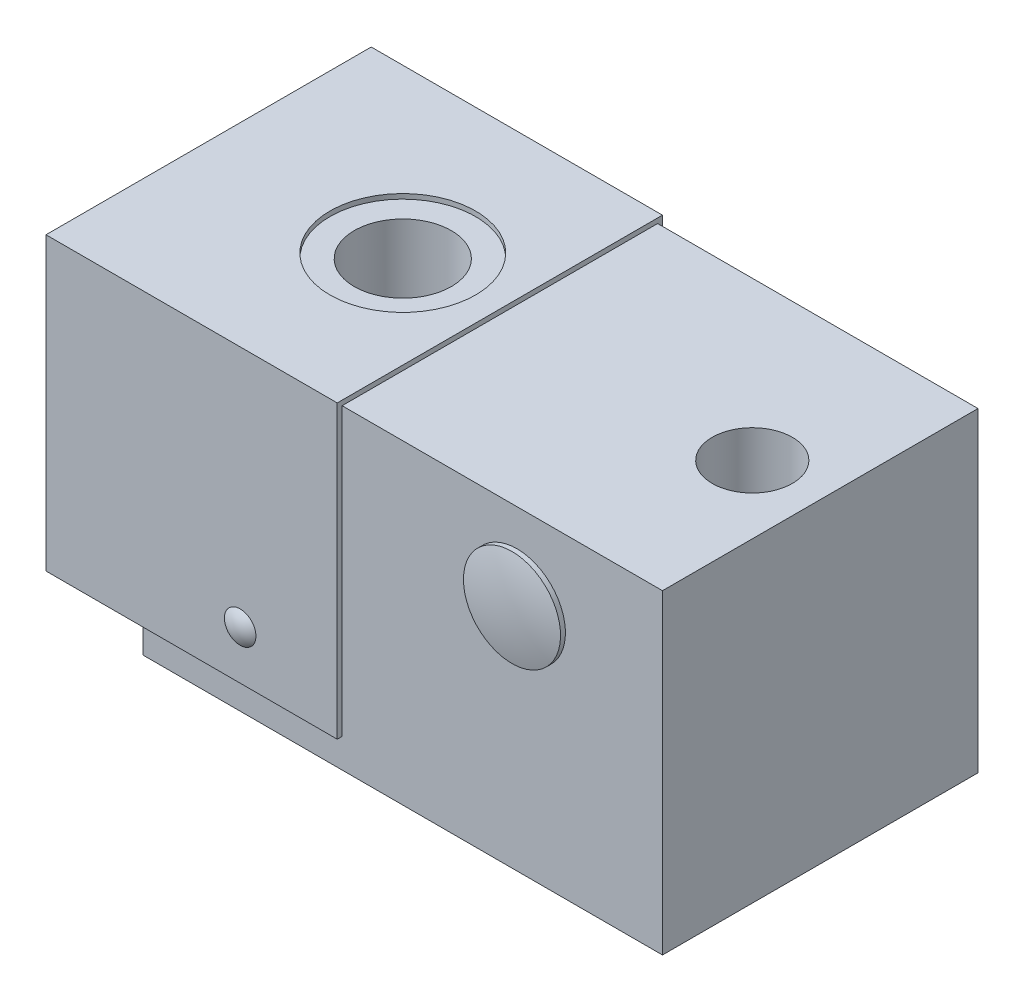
ISO-10303-21;
HEADER;
FILE_DESCRIPTION(('STEP AP214'),'2;1');
FILE_NAME('part.step','',(''),(''),'','','');
FILE_SCHEMA(('AUTOMOTIVE_DESIGN { 1 0 10303 214 1 1 1 1 }'));
ENDSEC;
DATA;
#1=APPLICATION_CONTEXT('core data for automotive mechanical design processes');
#2=APPLICATION_PROTOCOL_DEFINITION('international standard','automotive_design',2000,#1);
#3=PRODUCT_CONTEXT('',#1,'mechanical');
#4=PRODUCT('Part','Part','',(#3));
#5=PRODUCT_RELATED_PRODUCT_CATEGORY('part','',(#4));
#6=PRODUCT_DEFINITION_FORMATION('','',#4);
#7=PRODUCT_DEFINITION_CONTEXT('part definition',#1,'design');
#8=PRODUCT_DEFINITION('design','',#6,#7);
#9=PRODUCT_DEFINITION_SHAPE('','',#8);
#10=(LENGTH_UNIT() NAMED_UNIT(*) SI_UNIT(.MILLI.,.METRE.));
#11=(NAMED_UNIT(*) PLANE_ANGLE_UNIT() SI_UNIT($,.RADIAN.));
#12=(NAMED_UNIT(*) SI_UNIT($,.STERADIAN.) SOLID_ANGLE_UNIT());
#13=UNCERTAINTY_MEASURE_WITH_UNIT(LENGTH_MEASURE(1.E-05),#10,'distance_accuracy_value','');
#14=(GEOMETRIC_REPRESENTATION_CONTEXT(3) GLOBAL_UNCERTAINTY_ASSIGNED_CONTEXT((#13)) GLOBAL_UNIT_ASSIGNED_CONTEXT((#10,
#11,#12)) REPRESENTATION_CONTEXT('',''));
#15=CARTESIAN_POINT('',(0.,0.,0.));
#16=DIRECTION('',(0.,0.,1.));
#17=DIRECTION('',(1.,0.,0.));
#18=AXIS2_PLACEMENT_3D('',#15,#16,#17);
#19=CARTESIAN_POINT('',(34.5,0.,0.));
#20=DIRECTION('',(0.,1.,0.));
#21=DIRECTION('',(0.,0.,1.));
#22=AXIS2_PLACEMENT_3D('',#19,#20,#21);
#23=CYLINDRICAL_SURFACE('',#22,2.01);
#24=CARTESIAN_POINT('',(32.6488,15.5148894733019,-0.783044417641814));
#25=CARTESIAN_POINT('',(32.6614683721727,15.5434665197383,-0.812978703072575));
#26=CARTESIAN_POINT('',(32.674533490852,15.5729311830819,-0.841858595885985));
#27=CARTESIAN_POINT('',(32.7013192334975,15.6333220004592,-0.897669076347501));
#28=CARTESIAN_POINT('',(32.7150392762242,15.6642468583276,-0.924601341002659));
#29=CARTESIAN_POINT('',(32.7569040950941,15.7585818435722,-1.00259440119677));
#30=CARTESIAN_POINT('',(32.7858508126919,15.8237717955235,-1.05107390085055));
#31=CARTESIAN_POINT('',(32.8448477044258,15.9565498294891,-1.1416887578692));
#32=CARTESIAN_POINT('',(32.8748799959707,16.0240987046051,-1.18389461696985));
#33=CARTESIAN_POINT('',(32.9360370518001,16.1615583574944,-1.2635836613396));
#34=CARTESIAN_POINT('',(32.9671631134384,16.2314719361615,-1.30106097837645));
#35=CARTESIAN_POINT('',(33.0301825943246,16.3729179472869,-1.37185263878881));
#36=CARTESIAN_POINT('',(33.0620751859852,16.4444486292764,-1.40517125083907));
#37=CARTESIAN_POINT('',(33.1264910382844,16.5888111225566,-1.46819613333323));
#38=CARTESIAN_POINT('',(33.1590144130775,16.6616431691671,-1.49790174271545));
#39=CARTESIAN_POINT('',(33.2573468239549,16.8816630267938,-1.58221177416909));
#40=CARTESIAN_POINT('',(33.3239138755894,17.030364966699,-1.63200475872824));
#41=CARTESIAN_POINT('',(33.4591439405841,17.3318862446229,-1.7214364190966));
#42=CARTESIAN_POINT('',(33.5278219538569,17.484732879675,-1.76095739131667));
#43=CARTESIAN_POINT('',(33.6662364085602,17.792132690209,-1.83055688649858));
#44=CARTESIAN_POINT('',(33.735973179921,17.9466863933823,-1.86063240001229));
#45=CARTESIAN_POINT('',(33.8700959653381,18.2432355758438,-1.90996445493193));
#46=CARTESIAN_POINT('',(33.9344149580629,18.3851438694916,-1.92993843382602));
#47=CARTESIAN_POINT('',(34.0636031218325,18.6694963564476,-1.96318784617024));
#48=CARTESIAN_POINT('',(34.1284723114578,18.8119405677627,-1.97646305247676));
#49=CARTESIAN_POINT('',(34.2587325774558,19.0972194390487,-1.99655622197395));
#50=CARTESIAN_POINT('',(34.3241241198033,19.2400543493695,-2.00336756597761));
#51=CARTESIAN_POINT('',(34.4552887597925,19.5257141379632,-2.01057579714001));
#52=CARTESIAN_POINT('',(34.5210618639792,19.6685390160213,-2.010972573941));
#53=CARTESIAN_POINT('',(34.652727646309,19.9535086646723,-2.00526910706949));
#54=CARTESIAN_POINT('',(34.7186194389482,20.095654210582,-1.99918751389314));
#55=CARTESIAN_POINT('',(34.8506297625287,20.3793898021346,-1.98030433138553));
#56=CARTESIAN_POINT('',(34.9167482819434,20.5209798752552,-1.96750307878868));
#57=CARTESIAN_POINT('',(35.0490341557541,20.803098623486,-1.93476091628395));
#58=CARTESIAN_POINT('',(35.1152013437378,20.9436284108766,-1.91482901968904));
#59=CARTESIAN_POINT('',(35.2475139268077,21.2233428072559,-1.86715552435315));
#60=CARTESIAN_POINT('',(35.3136593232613,21.3625277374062,-1.83941584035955));
#61=CARTESIAN_POINT('',(35.4420087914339,21.6311995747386,-1.77694232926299));
#62=CARTESIAN_POINT('',(35.5042251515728,21.7607913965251,-1.74269004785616));
#63=CARTESIAN_POINT('',(35.6282004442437,22.0176057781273,-1.66511879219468));
#64=CARTESIAN_POINT('',(35.6899590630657,22.1448267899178,-1.62179410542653));
#65=CARTESIAN_POINT('',(35.8122139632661,22.3951312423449,-1.52455778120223));
#66=CARTESIAN_POINT('',(35.8727143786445,22.5182294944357,-1.47069022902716));
#67=CARTESIAN_POINT('',(35.9916946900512,22.7586971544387,-1.34987010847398));
#68=CARTESIAN_POINT('',(36.0501778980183,22.8760760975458,-1.28294032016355));
#69=CARTESIAN_POINT('',(36.1537103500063,23.0823915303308,-1.14517892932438));
#70=CARTESIAN_POINT('',(36.1993407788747,23.1727488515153,-1.0769956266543));
#71=CARTESIAN_POINT('',(36.2642321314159,23.3004900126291,-0.964079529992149));
#72=CARTESIAN_POINT('',(36.2852473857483,23.3417269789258,-0.924720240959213));
#73=CARTESIAN_POINT('',(36.3256939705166,23.420862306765,-0.842057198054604));
#74=CARTESIAN_POINT('',(36.3451265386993,23.4587632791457,-0.79875658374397));
#75=CARTESIAN_POINT('',(36.3837066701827,23.5338041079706,-0.703317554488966));
#76=CARTESIAN_POINT('',(36.4026337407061,23.5704935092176,-0.65072847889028));
#77=CARTESIAN_POINT('',(36.4369242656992,23.6367946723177,-0.540151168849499));
#78=CARTESIAN_POINT('',(36.4522911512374,23.6664132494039,-0.482168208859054));
#79=CARTESIAN_POINT('',(36.4762847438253,23.7125738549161,-0.370345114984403));
#80=CARTESIAN_POINT('',(36.4855773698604,23.730412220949,-0.317192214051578));
#81=CARTESIAN_POINT('',(36.4999333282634,23.7579454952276,-0.208264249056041));
#82=CARTESIAN_POINT('',(36.5050008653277,23.7676484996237,-0.152491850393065));
#83=CARTESIAN_POINT('',(36.5104070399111,23.7779992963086,-0.0396002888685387));
#84=CARTESIAN_POINT('',(36.5107236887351,23.7786049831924,0.0175239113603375));
#85=CARTESIAN_POINT('',(36.5065337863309,23.7705837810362,0.130942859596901));
#86=CARTESIAN_POINT('',(36.5020254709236,23.7619535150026,0.187237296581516));
#87=CARTESIAN_POINT('',(36.4891167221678,23.7372030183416,0.293591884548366));
#88=CARTESIAN_POINT('',(36.4809980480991,23.7216247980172,0.343816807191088));
#89=CARTESIAN_POINT('',(36.4615992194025,23.6843295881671,0.441248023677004));
#90=CARTESIAN_POINT('',(36.4503180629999,23.6626106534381,0.488453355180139));
#91=CARTESIAN_POINT('',(36.417157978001,23.5986196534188,0.608795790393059));
#92=CARTESIAN_POINT('',(36.3931298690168,23.5521134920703,0.679081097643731));
#93=CARTESIAN_POINT('',(36.3405886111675,23.44995380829,0.810800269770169));
#94=CARTESIAN_POINT('',(36.3120613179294,23.3942714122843,0.872205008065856));
#95=CARTESIAN_POINT('',(36.2556292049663,23.2836055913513,0.980372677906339));
#96=CARTESIAN_POINT('',(36.2280399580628,23.2292983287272,1.02800802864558));
#97=CARTESIAN_POINT('',(36.1712893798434,23.1171357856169,1.11790903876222));
#98=CARTESIAN_POINT('',(36.1421267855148,23.0592776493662,1.16017028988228));
#99=CARTESIAN_POINT('',(36.0826803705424,22.9408712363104,1.24004195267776));
#100=CARTESIAN_POINT('',(36.0523949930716,22.880319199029,1.2776455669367));
#101=CARTESIAN_POINT('',(35.9910510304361,22.7572045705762,1.34872765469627));
#102=CARTESIAN_POINT('',(35.9599921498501,22.694641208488,1.38220452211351));
#103=CARTESIAN_POINT('',(35.8627793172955,22.4981107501,1.48045400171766));
#104=CARTESIAN_POINT('',(35.7956972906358,22.361491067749,1.53902357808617));
#105=CARTESIAN_POINT('',(35.6603706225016,22.0839976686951,1.64344878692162));
#106=CARTESIAN_POINT('',(35.5921248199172,21.943119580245,1.68929082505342));
#107=CARTESIAN_POINT('',(35.4549484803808,21.6582479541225,1.77046218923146));
#108=CARTESIAN_POINT('',(35.3860166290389,21.514247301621,1.80576402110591));
#109=CARTESIAN_POINT('',(35.2480257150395,21.2244531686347,1.86715111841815));
#110=CARTESIAN_POINT('',(35.1789667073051,21.0786603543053,1.89323970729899));
#111=CARTESIAN_POINT('',(35.0448165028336,20.7941313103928,1.93596020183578));
#112=CARTESIAN_POINT('',(34.9797222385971,20.6554634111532,1.9530442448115));
#113=CARTESIAN_POINT('',(34.8496872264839,20.3773718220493,1.9804630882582));
#114=CARTESIAN_POINT('',(34.7847465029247,20.2379480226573,1.99079688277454));
#115=CARTESIAN_POINT('',(34.6550545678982,19.9585366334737,2.00507286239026));
#116=CARTESIAN_POINT('',(34.590303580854,19.8185486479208,2.00900926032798));
#117=CARTESIAN_POINT('',(34.461111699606,19.5383716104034,2.01066192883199));
#118=CARTESIAN_POINT('',(34.3966708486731,19.3981825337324,2.00837735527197));
#119=CARTESIAN_POINT('',(34.2681192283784,19.1177399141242,1.99762243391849));
#120=CARTESIAN_POINT('',(34.2040088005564,18.9774864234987,1.98914662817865));
#121=CARTESIAN_POINT('',(34.076259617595,18.6973077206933,1.96589906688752));
#122=CARTESIAN_POINT('',(34.0126207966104,18.5573824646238,1.95112820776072));
#123=CARTESIAN_POINT('',(33.8859573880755,18.2782509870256,1.9150417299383));
#124=CARTESIAN_POINT('',(33.8229322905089,18.1390442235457,1.89373212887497));
#125=CARTESIAN_POINT('',(33.6975731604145,17.8615910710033,1.84411429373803));
#126=CARTESIAN_POINT('',(33.6352389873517,17.7233444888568,1.81580751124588));
#127=CARTESIAN_POINT('',(33.5216833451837,17.4710327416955,1.75681041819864));
#128=CARTESIAN_POINT('',(33.4703306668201,17.356753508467,1.72729064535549));
#129=CARTESIAN_POINT('',(33.3683786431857,17.1295505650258,1.66228492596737));
#130=CARTESIAN_POINT('',(33.3177792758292,17.0166268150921,1.6267991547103));
#131=CARTESIAN_POINT('',(33.2179480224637,16.7935425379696,1.54932431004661));
#132=CARTESIAN_POINT('',(33.1687086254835,16.6833674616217,1.50738719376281));
#133=CARTESIAN_POINT('',(33.0715357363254,16.4656840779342,1.41565040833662));
#134=CARTESIAN_POINT('',(33.0236022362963,16.3581757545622,1.36585078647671));
#135=CARTESIAN_POINT('',(32.9470993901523,16.1864084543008,1.27696524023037));
#136=CARTESIAN_POINT('',(32.9179496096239,16.1209151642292,1.24076879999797));
#137=CARTESIAN_POINT('',(32.8606710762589,15.9921423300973,1.16404206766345));
#138=CARTESIAN_POINT('',(32.8325412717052,15.9288605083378,1.12351642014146));
#139=CARTESIAN_POINT('',(32.7773020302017,15.8045209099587,1.03686270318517));
#140=CARTESIAN_POINT('',(32.7502075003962,15.7434958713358,0.990677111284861));
#141=CARTESIAN_POINT('',(32.7109818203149,15.6551017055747,0.916675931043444));
#142=CARTESIAN_POINT('',(32.6981223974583,15.6261152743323,0.89117534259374));
#143=CARTESIAN_POINT('',(32.6729908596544,15.5694521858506,0.838443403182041));
#144=CARTESIAN_POINT('',(32.6607191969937,15.5417765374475,0.81121075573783));
#145=CARTESIAN_POINT('',(32.6488,15.5148894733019,0.783044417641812));
#146=B_SPLINE_CURVE_WITH_KNOTS('',3,(#24,#25,#26,#27,#28,#29,#30,#31,#32,#33,#34,#35,#36,#37,
#38,#39,#40,#41,#42,#43,#44,#45,#46,#47,#48,#49,#50,#51,#52,#53,#54,#55,#56,#57,#58,#59,#60,#61,
#62,#63,#64,#65,#66,#67,#68,#69,#70,#71,#72,#73,#74,#75,#76,#77,#78,#79,#80,#81,#82,#83,#84,#85,
#86,#87,#88,#89,#90,#91,#92,#93,#94,#95,#96,#97,#98,#99,#100,#101,#102,#103,#104,#105,#106,#107,
#108,#109,#110,#111,#112,#113,#114,#115,#116,#117,#118,#119,#120,#121,#122,#123,#124,#125,#126,
#127,#128,#129,#130,#131,#132,#133,#134,#135,#136,#137,#138,#139,#140,#141,#142,#143,#144,#145),
.UNSPECIFIED.,.F.,.F.,(4,2,2,2,2,2,2,2,2,2,2,2,2,2,2,2,2,2,2,2,2,2,2,2,2,2,2,2,2,2,2,2,2,2,2,2,
2,2,2,2,2,2,2,2,2,2,2,2,2,2,2,2,2,2,2,2,2,2,2,2,4),(0.,0.129775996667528,0.259438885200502,
0.51778806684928,0.772969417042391,1.02846440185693,1.28369494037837,1.5389721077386,
2.04956076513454,2.56576504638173,3.08213363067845,3.55322291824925,4.02432817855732,
4.49591534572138,4.96751062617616,5.4377518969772,5.90796960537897,6.37759503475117,
6.84710539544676,7.29018931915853,7.73355307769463,8.17510105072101,8.6158857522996,
8.98090236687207,9.16297951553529,9.34491287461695,9.54493753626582,9.74476861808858,
9.91456419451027,10.0841905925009,10.2546018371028,10.4250754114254,10.5840988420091,
10.7431727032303,11.0045718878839,11.2668098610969,11.4984574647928,11.7302938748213,
11.9624647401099,12.1947256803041,12.6831375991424,13.1720692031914,13.6622652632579,
14.1522843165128,14.6145332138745,15.0768509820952,15.5395867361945,16.0023852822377,
16.465592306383,16.9287333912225,17.3914495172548,17.8540697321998,18.2400974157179,
18.626113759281,19.0091699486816,19.3922238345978,19.6330218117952,19.8735639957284,
20.1167930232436,20.2388143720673,20.3609281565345),.UNSPECIFIED.);
#147=CARTESIAN_POINT('',(33.0824017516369,16.49,-1.4249614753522));
#148=VERTEX_POINT('',#147);
#149=CARTESIAN_POINT('',(33.0824017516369,16.49,1.4249614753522));
#150=VERTEX_POINT('',#149);
#151=EDGE_CURVE('E333',#148,#150,#146,.T.);
#152=ORIENTED_EDGE('',*,*,#151,.F.);
#153=CARTESIAN_POINT('',(34.5,16.49,0.));
#154=DIRECTION('',(0.,-1.,0.));
#155=DIRECTION('',(0.,0.,-1.));
#156=AXIS2_PLACEMENT_3D('',#153,#154,#155);
#157=CIRCLE('',#156,2.01);
#158=EDGE_CURVE('E64',#148,#150,#157,.T.);
#159=ORIENTED_EDGE('',*,*,#158,.T.);
#160=EDGE_LOOP('',(#152,#159));
#161=FACE_BOUND('',#160,.T.);
#162=ADVANCED_FACE('F35',(#161),#23,.F.);
#163=CARTESIAN_POINT('',(40.577499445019,32.5,0.));
#164=DIRECTION('',(-1.,0.,0.));
#165=DIRECTION('',(0.,0.,1.));
#166=AXIS2_PLACEMENT_3D('',#163,#164,#165);
#167=CYLINDRICAL_SURFACE('',#166,16.25);
#168=CARTESIAN_POINT('',(10.,32.5,0.));
#169=DIRECTION('',(-1.,0.,0.));
#170=DIRECTION('',(0.,0.,1.));
#171=AXIS2_PLACEMENT_3D('',#168,#169,#170);
#172=CIRCLE('',#171,16.25);
#173=CARTESIAN_POINT('',(10.,32.5,16.25));
#174=VERTEX_POINT('',#173);
#175=EDGE_CURVE('E450',#174,#174,#172,.T.);
#176=ORIENTED_EDGE('',*,*,#175,.T.);
#177=EDGE_LOOP('',(#176));
#178=FACE_BOUND('',#177,.T.);
#179=CARTESIAN_POINT('',(33.,32.5,0.));
#180=DIRECTION('',(-1.,0.,0.));
#181=DIRECTION('',(0.,0.,1.));
#182=AXIS2_PLACEMENT_3D('',#179,#180,#181);
#183=CIRCLE('',#182,16.25);
#184=CARTESIAN_POINT('',(33.,16.3263284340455,1.57316498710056));
#185=VERTEX_POINT('',#184);
#186=CARTESIAN_POINT('',(33.,42.6269099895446,12.7085874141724));
#187=VERTEX_POINT('',#186);
#188=EDGE_CURVE('E446',#185,#187,#183,.T.);
#189=ORIENTED_EDGE('',*,*,#188,.F.);
#190=CARTESIAN_POINT('',(33.1002,16.3342501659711,1.65258352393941));
#191=CARTESIAN_POINT('',(33.0145486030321,16.3277149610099,1.58866492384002));
#192=CARTESIAN_POINT('',(32.9335191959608,16.3209283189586,1.51852621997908));
#193=CARTESIAN_POINT('',(32.7823685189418,16.3074169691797,1.36694968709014));
#194=CARTESIAN_POINT('',(32.7122787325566,16.3006924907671,1.28548047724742));
#195=CARTESIAN_POINT('',(32.5757932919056,16.286970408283,1.10000894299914));
#196=CARTESIAN_POINT('',(32.5114712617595,16.2800790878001,0.994455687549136));
#197=CARTESIAN_POINT('',(32.4027776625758,16.2680461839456,0.773545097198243));
#198=CARTESIAN_POINT('',(32.358385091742,16.2629027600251,0.658198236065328));
#199=CARTESIAN_POINT('',(32.2934835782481,16.2552650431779,0.42836878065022));
#200=CARTESIAN_POINT('',(32.2716997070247,16.2526301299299,0.314250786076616));
#201=CARTESIAN_POINT('',(32.2483986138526,16.2498089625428,0.0839138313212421));
#202=CARTESIAN_POINT('',(32.2468810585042,16.2496226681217,-0.0323050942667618));
#203=CARTESIAN_POINT('',(32.2638082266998,16.2516758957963,-0.258259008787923));
#204=CARTESIAN_POINT('',(32.2814070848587,16.2538126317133,-0.368059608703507));
#205=CARTESIAN_POINT('',(32.3345215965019,16.2601104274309,-0.583152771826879));
#206=CARTESIAN_POINT('',(32.3700354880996,16.2642712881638,-0.688445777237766));
#207=CARTESIAN_POINT('',(32.4580273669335,16.2742138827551,-0.892710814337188));
#208=CARTESIAN_POINT('',(32.5106571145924,16.2800100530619,-0.991616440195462));
#209=CARTESIAN_POINT('',(32.6309812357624,16.2926060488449,-1.17973649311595));
#210=CARTESIAN_POINT('',(32.6986768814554,16.2994059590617,-1.26895010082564));
#211=CARTESIAN_POINT('',(32.8221519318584,16.3110042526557,-1.40784693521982));
#212=CARTESIAN_POINT('',(32.874350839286,16.3157119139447,-1.46077577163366));
#213=CARTESIAN_POINT('',(32.9836999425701,16.3250690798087,-1.56096966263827));
#214=CARTESIAN_POINT('',(33.0408377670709,16.3297186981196,-1.60824820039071));
#215=CARTESIAN_POINT('',(33.1002,16.3342501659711,-1.6525835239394));
#216=B_SPLINE_CURVE_WITH_KNOTS('',3,(#190,#191,#192,#193,#194,#195,#196,#197,#198,#199,#200,
#201,#202,#203,#204,#205,#206,#207,#208,#209,#210,#211,#212,#213,#214,#215),.UNSPECIFIED.,.F.,
.F.,(4,2,2,2,2,2,2,2,2,2,2,2,4),(0.,0.320981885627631,0.64287114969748,1.01228989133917,
1.38131841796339,1.7281709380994,2.07501775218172,2.40711991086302,2.7391894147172,
3.07428742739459,3.40941374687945,3.6325207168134,3.85508418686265),.UNSPECIFIED.);
#217=CARTESIAN_POINT('',(33.,16.3263284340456,-1.57316498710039));
#218=VERTEX_POINT('',#217);
#219=EDGE_CURVE('E307',#185,#218,#216,.T.);
#220=ORIENTED_EDGE('',*,*,#219,.T.);
#221=CARTESIAN_POINT('',(33.,42.6269099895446,-12.7085874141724));
#222=VERTEX_POINT('',#221);
#223=EDGE_CURVE('E447',#222,#218,#183,.T.);
#224=ORIENTED_EDGE('',*,*,#223,.F.);
#225=CARTESIAN_POINT('',(33.,42.6269099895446,-12.7085874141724));
#226=CARTESIAN_POINT('',(32.8660249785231,42.7093514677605,-12.6429087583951));
#227=CARTESIAN_POINT('',(32.7372955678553,42.7962511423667,-12.5723374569));
#228=CARTESIAN_POINT('',(32.4909051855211,42.9771156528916,-12.4220065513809));
#229=CARTESIAN_POINT('',(32.3732306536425,43.071071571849,-12.3422584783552));
#230=CARTESIAN_POINT('',(32.1502374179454,43.2635088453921,-12.1747902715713));
#231=CARTESIAN_POINT('',(32.0448136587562,43.3619397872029,-12.0871514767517));
#232=CARTESIAN_POINT('',(31.845065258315,43.5625440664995,-11.9038261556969));
#233=CARTESIAN_POINT('',(31.7507437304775,43.6647184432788,-11.8081373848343));
#234=CARTESIAN_POINT('',(31.573450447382,43.8708044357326,-11.6098089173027));
#235=CARTESIAN_POINT('',(31.490427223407,43.9747055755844,-11.5072041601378));
#236=CARTESIAN_POINT('',(31.3348046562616,44.1833900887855,-11.2952651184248));
#237=CARTESIAN_POINT('',(31.2622044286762,44.288173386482,-11.1859314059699));
#238=CARTESIAN_POINT('',(31.1267148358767,44.4977174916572,-10.960883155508));
#239=CARTESIAN_POINT('',(31.0638466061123,44.6024777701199,-10.8451554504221));
#240=CARTESIAN_POINT('',(30.9473322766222,44.8107988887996,-10.6080942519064));
#241=CARTESIAN_POINT('',(30.8936884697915,44.9143594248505,-10.4867593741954));
#242=CARTESIAN_POINT('',(30.7621589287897,45.1874533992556,-10.156889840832));
#243=CARTESIAN_POINT('',(30.691773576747,45.3552160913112,-9.94386519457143));
#244=CARTESIAN_POINT('',(30.5710516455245,45.6823221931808,-9.50598313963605));
#245=CARTESIAN_POINT('',(30.5207259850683,45.8416609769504,-9.28111936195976));
#246=CARTESIAN_POINT('',(30.4366355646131,46.1503228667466,-8.82089181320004));
#247=CARTESIAN_POINT('',(30.4029106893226,46.2996211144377,-8.58550422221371));
#248=CARTESIAN_POINT('',(30.349002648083,46.5864793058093,-8.10627229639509));
#249=CARTESIAN_POINT('',(30.3288189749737,46.7240396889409,-7.86242827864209));
#250=CARTESIAN_POINT('',(30.2914268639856,47.0537328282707,-7.24089032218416));
#251=CARTESIAN_POINT('',(30.2810140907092,47.2378141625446,-6.85849601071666));
#252=CARTESIAN_POINT('',(30.2755077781,47.5755490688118,-6.08033597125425));
#253=CARTESIAN_POINT('',(30.280421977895,47.7291872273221,-5.68456358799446));
#254=CARTESIAN_POINT('',(30.298152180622,48.0050176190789,-4.88230219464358));
#255=CARTESIAN_POINT('',(30.3109700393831,48.1272024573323,-4.47581068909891));
#256=CARTESIAN_POINT('',(30.338383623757,48.3393761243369,-3.65465254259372));
#257=CARTESIAN_POINT('',(30.3529790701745,48.4293700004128,-3.23998719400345));
#258=CARTESIAN_POINT('',(30.3795956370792,48.5789026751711,-2.39212109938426));
#259=CARTESIAN_POINT('',(30.3915253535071,48.6374360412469,-1.95873943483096));
#260=CARTESIAN_POINT('',(30.4087695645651,48.7193904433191,-1.08851832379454));
#261=CARTESIAN_POINT('',(30.4140839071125,48.7428106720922,-0.651678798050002));
#262=CARTESIAN_POINT('',(30.4166645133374,48.754356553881,0.222584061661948));
#263=CARTESIAN_POINT('',(30.413929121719,48.7424749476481,0.66000749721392));
#264=CARTESIAN_POINT('',(30.4011394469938,48.6834957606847,1.53234822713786));
#265=CARTESIAN_POINT('',(30.3910852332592,48.6363985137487,1.96726554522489));
#266=CARTESIAN_POINT('',(30.3661263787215,48.505501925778,2.84401185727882));
#267=CARTESIAN_POINT('',(30.3510923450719,48.4207002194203,3.28568739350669));
#268=CARTESIAN_POINT('',(30.321362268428,48.2147631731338,4.16061745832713));
#269=CARTESIAN_POINT('',(30.3066663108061,48.0936187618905,4.59386985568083));
#270=CARTESIAN_POINT('',(30.2845303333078,47.8159036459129,5.44861114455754));
#271=CARTESIAN_POINT('',(30.2770832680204,47.6593675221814,5.870111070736));
#272=CARTESIAN_POINT('',(30.2779527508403,47.3119193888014,6.69857864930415));
#273=CARTESIAN_POINT('',(30.2862590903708,47.1210297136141,7.10555553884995));
#274=CARTESIAN_POINT('',(30.3199963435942,46.7934826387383,7.73479445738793));
#275=CARTESIAN_POINT('',(30.3368143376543,46.6675246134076,7.96313584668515));
#276=CARTESIAN_POINT('',(30.3816082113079,46.4052921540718,8.41266821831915));
#277=CARTESIAN_POINT('',(30.4095810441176,46.2690205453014,8.63386113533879));
#278=CARTESIAN_POINT('',(30.4791785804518,45.9871933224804,9.06779996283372));
#279=CARTESIAN_POINT('',(30.5207915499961,45.8416457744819,9.28055295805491));
#280=CARTESIAN_POINT('',(30.6203909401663,45.5425407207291,9.69639893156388));
#281=CARTESIAN_POINT('',(30.6783732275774,45.3889852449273,9.89949433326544));
#282=CARTESIAN_POINT('',(30.7975203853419,45.1129213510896,10.2476217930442));
#283=CARTESIAN_POINT('',(30.8546840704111,44.9916663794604,10.3950195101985));
#284=CARTESIAN_POINT('',(30.9814177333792,44.7468510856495,10.6823558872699));
#285=CARTESIAN_POINT('',(31.0509841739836,44.623291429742,10.8222966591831));
#286=CARTESIAN_POINT('',(31.2034468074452,44.375716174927,11.0933971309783));
#287=CARTESIAN_POINT('',(31.2863006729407,44.2517032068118,11.2245829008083));
#288=CARTESIAN_POINT('',(31.4664673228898,44.0046534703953,11.4776609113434));
#289=CARTESIAN_POINT('',(31.5637784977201,43.8816165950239,11.5995541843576));
#290=CARTESIAN_POINT('',(31.7572033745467,43.6575996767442,11.8148518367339));
#291=CARTESIAN_POINT('',(31.8511454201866,43.5561675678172,11.9097372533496));
#292=CARTESIAN_POINT('',(32.0499831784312,43.3570341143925,12.0915458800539));
#293=CARTESIAN_POINT('',(32.1548747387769,43.2593313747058,12.1784720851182));
#294=CARTESIAN_POINT('',(32.3767196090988,43.0682443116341,12.3446703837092));
#295=CARTESIAN_POINT('',(32.4937838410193,42.974913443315,12.4238564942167));
#296=CARTESIAN_POINT('',(32.7388284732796,42.795217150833,12.5731768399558));
#297=CARTESIAN_POINT('',(32.8668230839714,42.7088610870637,12.6432989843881));
#298=CARTESIAN_POINT('',(33.,42.6269099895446,12.7085874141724));
#299=B_SPLINE_CURVE_WITH_KNOTS('',3,(#225,#226,#227,#228,#229,#230,#231,#232,#233,#234,#235,
#236,#237,#238,#239,#240,#241,#242,#243,#244,#245,#246,#247,#248,#249,#250,#251,#252,#253,#254,
#255,#256,#257,#258,#259,#260,#261,#262,#263,#264,#265,#266,#267,#268,#269,#270,#271,#272,#273,
#274,#275,#276,#277,#278,#279,#280,#281,#282,#283,#284,#285,#286,#287,#288,#289,#290,#291,#292,
#293,#294,#295,#296,#297,#298),.UNSPECIFIED.,.F.,.F.,(4,2,2,2,2,2,2,2,2,2,2,2,2,2,2,2,2,2,2,2,2,
2,2,2,2,2,2,2,2,2,2,2,2,2,2,2,4),(0.,0.511082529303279,1.02152973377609,1.52721351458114,
2.03303876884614,2.5364765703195,3.0398716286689,3.54434504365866,4.04894367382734,
4.88801182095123,5.72753606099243,6.56906759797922,7.41056761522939,8.68225017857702,
9.95457496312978,11.2271986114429,12.4996226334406,13.8106018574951,15.1216112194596,
16.4328901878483,17.7441567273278,19.0925866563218,20.4413534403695,21.7888080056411,
23.1353896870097,23.9189026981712,24.7022018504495,25.4848289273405,26.2672585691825,
26.8645049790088,27.4615813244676,28.0567921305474,28.6519367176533,29.1544369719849,
29.6567473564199,30.164120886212,30.6721643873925),.UNSPECIFIED.);
#300=EDGE_CURVE('E382',#222,#187,#299,.T.);
#301=ORIENTED_EDGE('',*,*,#300,.T.);
#302=EDGE_LOOP('',(#189,#220,#224,#301));
#303=FACE_BOUND('',#302,.T.);
#304=ADVANCED_FACE('F315',(#178,#303),#167,.F.);
#305=CARTESIAN_POINT('',(40.577499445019,32.5,0.));
#306=DIRECTION('',(-1.,0.,0.));
#307=DIRECTION('',(0.,0.,1.));
#308=AXIS2_PLACEMENT_3D('',#305,#306,#307);
#309=CONICAL_SURFACE('',#308,0.,1.1344640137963);
#310=CARTESIAN_POINT('',(40.577499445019,32.5,0.));
#311=VERTEX_POINT('',#310);
#312=VERTEX_LOOP('',#311);
#313=FACE_BOUND('',#312,.T.);
#314=ORIENTED_EDGE('',*,*,#151,.T.);
#315=CARTESIAN_POINT('',(33.0875226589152,16.5002,1.41566514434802));
#316=CARTESIAN_POINT('',(33.0729742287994,16.4712174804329,1.44208317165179));
#317=CARTESIAN_POINT('',(33.0583897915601,16.4422039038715,1.46844690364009));
#318=CARTESIAN_POINT('',(33.0291489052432,16.3841146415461,1.52106577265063));
#319=CARTESIAN_POINT('',(33.0144924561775,16.3550389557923,1.54732090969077));
#320=CARTESIAN_POINT('',(32.9998,16.3259322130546,1.57352175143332));
#321=B_SPLINE_CURVE_WITH_KNOTS('',3,(#315,#316,#317,#318,#319,#320),.UNSPECIFIED.,.F.,.F.,(4,2,
4),(0.,0.125482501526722,0.250964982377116),.UNSPECIFIED.);
#322=EDGE_CURVE('E11',#150,#185,#321,.T.);
#323=ORIENTED_EDGE('',*,*,#322,.T.);
#324=ORIENTED_EDGE('',*,*,#188,.T.);
#325=CARTESIAN_POINT('',(32.2420500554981,43.1843519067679,14.3309309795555));
#326=CARTESIAN_POINT('',(32.2882375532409,43.1441383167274,14.2373640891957));
#327=CARTESIAN_POINT('',(32.3342596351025,43.1053614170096,14.1431107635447));
#328=CARTESIAN_POINT('',(32.4259484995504,43.0304725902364,13.9533957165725));
#329=CARTESIAN_POINT('',(32.4716153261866,42.9943603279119,13.8579341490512));
#330=CARTESIAN_POINT('',(32.6080056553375,42.8897378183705,13.5700704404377));
#331=CARTESIAN_POINT('',(32.6981779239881,42.8248911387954,13.3760696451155));
#332=CARTESIAN_POINT('',(32.8766808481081,42.7038056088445,12.985180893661));
#333=CARTESIAN_POINT('',(32.9650152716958,42.6475472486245,12.7883006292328));
#334=CARTESIAN_POINT('',(33.1399323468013,42.5424383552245,12.3917743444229));
#335=CARTESIAN_POINT('',(33.2265146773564,42.4935891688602,12.192127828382));
#336=CARTESIAN_POINT('',(33.4842389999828,42.3564561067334,11.5877765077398));
#337=CARTESIAN_POINT('',(33.6524940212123,42.2781543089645,11.1795555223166));
#338=CARTESIAN_POINT('',(33.9800063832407,42.1429529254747,10.3557157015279));
#339=CARTESIAN_POINT('',(34.1392556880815,42.0860722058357,9.94009068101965));
#340=CARTESIAN_POINT('',(34.4314366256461,41.9947640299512,9.14465990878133));
#341=CARTESIAN_POINT('',(34.5654079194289,41.9586608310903,8.76542516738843));
#342=CARTESIAN_POINT('',(34.8228555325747,41.8983208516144,8.00243708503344));
#343=CARTESIAN_POINT('',(34.9463307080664,41.8740853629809,7.61868325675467));
#344=CARTESIAN_POINT('',(35.1808522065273,41.8351847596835,6.84676458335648));
#345=CARTESIAN_POINT('',(35.2918941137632,41.8205230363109,6.45859822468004));
#346=CARTESIAN_POINT('',(35.4992303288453,41.798499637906,5.67814025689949));
#347=CARTESIAN_POINT('',(35.5955251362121,41.7911377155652,5.28584878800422));
#348=CARTESIAN_POINT('',(35.7704146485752,41.7814394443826,4.49949970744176));
#349=CARTESIAN_POINT('',(35.8491030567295,41.7790758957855,4.10546340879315));
#350=CARTESIAN_POINT('',(35.9869799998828,41.7770979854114,3.31395918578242));
#351=CARTESIAN_POINT('',(36.0461687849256,41.7774835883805,2.91649130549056));
#352=CARTESIAN_POINT('',(36.1427965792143,41.7790764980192,2.11931358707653));
#353=CARTESIAN_POINT('',(36.1802582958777,41.7802829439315,1.71960653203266));
#354=CARTESIAN_POINT('',(36.2319477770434,41.7821425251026,0.91868847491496));
#355=CARTESIAN_POINT('',(36.2461768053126,41.7827956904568,0.517477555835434));
#356=CARTESIAN_POINT('',(36.2505938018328,41.7829904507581,-0.253967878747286));
#357=CARTESIAN_POINT('',(36.2425595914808,41.782614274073,-0.624193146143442));
#358=CARTESIAN_POINT('',(36.2065026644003,41.7811989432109,-1.3636572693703));
#359=CARTESIAN_POINT('',(36.1784799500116,41.7801597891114,-1.73289612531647));
#360=CARTESIAN_POINT('',(36.1034468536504,41.778313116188,-2.46969105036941));
#361=CARTESIAN_POINT('',(36.0564229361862,41.7775057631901,-2.83724573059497));
#362=CARTESIAN_POINT('',(35.94496119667,41.7774943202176,-3.56966358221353));
#363=CARTESIAN_POINT('',(35.8805229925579,41.778290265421,-3.93452669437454));
#364=CARTESIAN_POINT('',(35.6630512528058,41.785581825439,-5.02863695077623));
#365=CARTESIAN_POINT('',(35.486321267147,41.7970272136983,-5.75325446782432));
#366=CARTESIAN_POINT('',(35.185768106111,41.834822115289,-6.82917012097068));
#367=CARTESIAN_POINT('',(35.0796582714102,41.8508615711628,-7.18601825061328));
#368=CARTESIAN_POINT('',(34.8572831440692,41.8916158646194,-7.89604070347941));
#369=CARTESIAN_POINT('',(34.7410183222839,41.9163303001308,-8.24921519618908));
#370=CARTESIAN_POINT('',(34.4486062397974,41.9889575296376,-9.100925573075));
#371=CARTESIAN_POINT('',(34.267995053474,42.0422647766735,-9.59750446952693));
#372=CARTESIAN_POINT('',(33.9866369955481,42.1424581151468,-10.3352855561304));
#373=CARTESIAN_POINT('',(33.8911597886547,42.1792051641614,-10.5799139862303));
#374=CARTESIAN_POINT('',(33.6970139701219,42.2603112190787,-11.0666744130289));
#375=CARTESIAN_POINT('',(33.5983450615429,42.3046709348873,-11.308806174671));
#376=CARTESIAN_POINT('',(33.3987277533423,42.4017026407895,-11.7887249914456));
#377=CARTESIAN_POINT('',(33.2977962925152,42.4543239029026,-12.0265292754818));
#378=CARTESIAN_POINT('',(33.0933821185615,42.5692466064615,-12.498617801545));
#379=CARTESIAN_POINT('',(32.9899000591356,42.6315455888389,-12.7329029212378));
#380=CARTESIAN_POINT('',(32.7802847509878,42.767546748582,-13.1978614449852));
#381=CARTESIAN_POINT('',(32.6741447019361,42.8412813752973,-13.4285224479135));
#382=CARTESIAN_POINT('',(32.5133156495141,42.9618808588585,-13.7703455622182));
#383=CARTESIAN_POINT('',(32.4594119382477,43.0037676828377,-13.8836410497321));
#384=CARTESIAN_POINT('',(32.3510996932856,43.0912178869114,-14.1085863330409));
#385=CARTESIAN_POINT('',(32.2966910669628,43.1367819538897,-14.2202358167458));
#386=CARTESIAN_POINT('',(32.2420500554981,43.1843519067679,-14.3309309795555));
#387=B_SPLINE_CURVE_WITH_KNOTS('',3,(#325,#326,#327,#328,#329,#330,#331,#332,#333,#334,#335,
#336,#337,#338,#339,#340,#341,#342,#343,#344,#345,#346,#347,#348,#349,#350,#351,#352,#353,#354,
#355,#356,#357,#358,#359,#360,#361,#362,#363,#364,#365,#366,#367,#368,#369,#370,#371,#372,#373,
#374,#375,#376,#377,#378,#379,#380,#381,#382,#383,#384,#385,#386),.UNSPECIFIED.,.F.,.F.,(4,2,2,
2,2,2,2,2,2,2,2,2,2,2,2,2,2,2,2,2,2,2,2,2,2,2,2,2,2,2,4),(0.,0.335451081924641,
0.670859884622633,1.34124993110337,2.01009365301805,2.67905880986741,4.02345353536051,
5.36902954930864,6.58014225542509,7.79138678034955,9.00306012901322,10.2146924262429,
11.4197142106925,12.6247205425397,13.8284652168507,15.0321444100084,16.1425328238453,
17.2529211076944,18.3641017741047,19.4753068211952,21.7102009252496,22.8279323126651,
23.9456119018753,25.5378966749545,26.3332648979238,27.1287073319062,27.9194439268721,
28.7099799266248,29.5028016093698,29.8995635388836,30.296399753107),.UNSPECIFIED.);
#388=EDGE_CURVE('E350',#187,#222,#387,.T.);
#389=ORIENTED_EDGE('',*,*,#388,.T.);
#390=ORIENTED_EDGE('',*,*,#223,.T.);
#391=CARTESIAN_POINT('',(32.9998,16.3259322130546,-1.57352175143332));
#392=CARTESIAN_POINT('',(33.0144924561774,16.3550389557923,-1.54732090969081));
#393=CARTESIAN_POINT('',(33.0291489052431,16.384114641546,-1.52106577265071));
#394=CARTESIAN_POINT('',(33.05838979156,16.4422039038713,-1.46844690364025));
#395=CARTESIAN_POINT('',(33.0729742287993,16.4712174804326,-1.44208317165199));
#396=CARTESIAN_POINT('',(33.087522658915,16.5001999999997,-1.41566514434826));
#397=B_SPLINE_CURVE_WITH_KNOTS('',3,(#391,#392,#393,#394,#395,#396),.UNSPECIFIED.,.F.,.F.,(4,2,
4),(0.,0.125482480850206,0.250964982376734),.UNSPECIFIED.);
#398=EDGE_CURVE('E49',#218,#148,#397,.T.);
#399=ORIENTED_EDGE('',*,*,#398,.T.);
#400=EDGE_LOOP('',(#314,#323,#324,#389,#390,#399));
#401=FACE_BOUND('',#400,.T.);
#402=ADVANCED_FACE('F339',(#313,#401),#309,.F.);
#403=CARTESIAN_POINT('',(34.5,6.5,0.));
#404=DIRECTION('',(0.,-1.,0.));
#405=DIRECTION('',(0.,0.,-1.));
#406=AXIS2_PLACEMENT_3D('',#403,#404,#405);
#407=PLANE('',#406);
#408=CARTESIAN_POINT('',(34.5,6.5,0.));
#409=DIRECTION('',(0.,-1.,0.));
#410=DIRECTION('',(0.,0.,-1.));
#411=AXIS2_PLACEMENT_3D('',#408,#409,#410);
#412=CIRCLE('',#411,4.55);
#413=CARTESIAN_POINT('',(34.5,6.5,-4.55));
#414=VERTEX_POINT('',#413);
#415=EDGE_CURVE('E780',#414,#414,#412,.T.);
#416=ORIENTED_EDGE('',*,*,#415,.T.);
#417=EDGE_LOOP('',(#416));
#418=FACE_BOUND('',#417,.T.);
#419=CARTESIAN_POINT('',(34.5,6.5,0.));
#420=DIRECTION('',(0.,1.,0.));
#421=DIRECTION('',(0.,0.,1.));
#422=AXIS2_PLACEMENT_3D('',#419,#420,#421);
#423=CIRCLE('',#422,4.25);
#424=CARTESIAN_POINT('',(34.5,6.5,4.25));
#425=VERTEX_POINT('',#424);
#426=EDGE_CURVE('E301',#425,#425,#423,.T.);
#427=ORIENTED_EDGE('',*,*,#426,.T.);
#428=EDGE_LOOP('',(#427));
#429=FACE_BOUND('',#428,.T.);
#430=ADVANCED_FACE('F343',(#418,#429),#407,.T.);
#431=CARTESIAN_POINT('',(-60.,0.,33.5));
#432=DIRECTION('',(0.,1.,0.));
#433=DIRECTION('',(0.,0.,1.));
#434=AXIS2_PLACEMENT_3D('',#431,#432,#433);
#435=PLANE('',#434);
#436=CARTESIAN_POINT('',(-20.,0.,0.));
#437=DIRECTION('',(0.,1.,0.));
#438=DIRECTION('',(0.,0.,1.));
#439=AXIS2_PLACEMENT_3D('',#436,#437,#438);
#440=CIRCLE('',#439,10.);
#441=CARTESIAN_POINT('',(-20.,0.,10.));
#442=VERTEX_POINT('',#441);
#443=EDGE_CURVE('E389',#442,#442,#440,.T.);
#444=ORIENTED_EDGE('',*,*,#443,.T.);
#445=EDGE_LOOP('',(#444));
#446=FACE_BOUND('',#445,.T.);
#447=CARTESIAN_POINT('',(52.,0.,-23.5));
#448=DIRECTION('',(0.,1.,0.));
#449=DIRECTION('',(0.,0.,1.));
#450=AXIS2_PLACEMENT_3D('',#447,#448,#449);
#451=CIRCLE('',#450,5.);
#452=CARTESIAN_POINT('',(52.,0.,-18.5));
#453=VERTEX_POINT('',#452);
#454=EDGE_CURVE('E419',#453,#453,#451,.T.);
#455=ORIENTED_EDGE('',*,*,#454,.T.);
#456=EDGE_LOOP('',(#455));
#457=FACE_BOUND('',#456,.T.);
#458=CARTESIAN_POINT('',(52.,0.,23.5));
#459=DIRECTION('',(0.,1.,0.));
#460=DIRECTION('',(0.,0.,1.));
#461=AXIS2_PLACEMENT_3D('',#458,#459,#460);
#462=CIRCLE('',#461,5.);
#463=CARTESIAN_POINT('',(52.,0.,28.5));
#464=VERTEX_POINT('',#463);
#465=EDGE_CURVE('E437',#464,#464,#462,.T.);
#466=ORIENTED_EDGE('',*,*,#465,.T.);
#467=EDGE_LOOP('',(#466));
#468=FACE_BOUND('',#467,.T.);
#469=DIRECTION('',(0.,0.,-1.));
#470=VECTOR('',#469,1.);
#471=CARTESIAN_POINT('',(-41.,0.,32.5));
#472=LINE('',#471,#470);
#473=CARTESIAN_POINT('',(-41.,0.,32.5));
#474=VERTEX_POINT('',#473);
#475=CARTESIAN_POINT('',(-41.,0.,-32.5));
#476=VERTEX_POINT('',#475);
#477=EDGE_CURVE('E496',#474,#476,#472,.T.);
#478=ORIENTED_EDGE('',*,*,#477,.T.);
#479=DIRECTION('',(-1.,0.,0.));
#480=VECTOR('',#479,1.);
#481=CARTESIAN_POINT('',(66.,0.,-32.5));
#482=LINE('',#481,#480);
#483=CARTESIAN_POINT('',(66.,0.,-32.5));
#484=VERTEX_POINT('',#483);
#485=EDGE_CURVE('E519',#484,#476,#482,.T.);
#486=ORIENTED_EDGE('',*,*,#485,.F.);
#487=DIRECTION('',(0.,0.,-1.));
#488=VECTOR('',#487,1.);
#489=CARTESIAN_POINT('',(66.,0.,32.5));
#490=LINE('',#489,#488);
#491=CARTESIAN_POINT('',(66.,0.,32.5));
#492=VERTEX_POINT('',#491);
#493=EDGE_CURVE('E528',#492,#484,#490,.T.);
#494=ORIENTED_EDGE('',*,*,#493,.F.);
#495=DIRECTION('',(1.,0.,0.));
#496=VECTOR('',#495,1.);
#497=CARTESIAN_POINT('',(0.,0.,32.5));
#498=LINE('',#497,#496);
#499=EDGE_CURVE('E514',#474,#492,#498,.T.);
#500=ORIENTED_EDGE('',*,*,#499,.F.);
#501=EDGE_LOOP('',(#478,#486,#494,#500));
#502=FACE_BOUND('',#501,.T.);
#503=CARTESIAN_POINT('',(52.,0.,0.));
#504=DIRECTION('',(0.,1.,0.));
#505=DIRECTION('',(0.,0.,1.));
#506=AXIS2_PLACEMENT_3D('',#503,#504,#505);
#507=CIRCLE('',#506,8.25);
#508=CARTESIAN_POINT('',(52.,0.,8.25));
#509=VERTEX_POINT('',#508);
#510=EDGE_CURVE('E440',#509,#509,#507,.T.);
#511=ORIENTED_EDGE('',*,*,#510,.T.);
#512=EDGE_LOOP('',(#511));
#513=FACE_BOUND('',#512,.T.);
#514=CARTESIAN_POINT('',(-31.,0.,23.5));
#515=DIRECTION('',(0.,1.,0.));
#516=DIRECTION('',(0.,0.,1.));
#517=AXIS2_PLACEMENT_3D('',#514,#515,#516);
#518=CIRCLE('',#517,5.);
#519=CARTESIAN_POINT('',(-31.,0.,28.5));
#520=VERTEX_POINT('',#519);
#521=EDGE_CURVE('E428',#520,#520,#518,.T.);
#522=ORIENTED_EDGE('',*,*,#521,.T.);
#523=EDGE_LOOP('',(#522));
#524=FACE_BOUND('',#523,.T.);
#525=CARTESIAN_POINT('',(-31.,0.,-23.5));
#526=DIRECTION('',(0.,1.,0.));
#527=DIRECTION('',(0.,0.,1.));
#528=AXIS2_PLACEMENT_3D('',#525,#526,#527);
#529=CIRCLE('',#528,5.);
#530=CARTESIAN_POINT('',(-31.,0.,-18.5));
#531=VERTEX_POINT('',#530);
#532=EDGE_CURVE('E410',#531,#531,#529,.T.);
#533=ORIENTED_EDGE('',*,*,#532,.T.);
#534=EDGE_LOOP('',(#533));
#535=FACE_BOUND('',#534,.T.);
#536=CARTESIAN_POINT('',(34.5,0.,0.));
#537=DIRECTION('',(0.,1.,0.));
#538=DIRECTION('',(0.,0.,1.));
#539=AXIS2_PLACEMENT_3D('',#536,#537,#538);
#540=CIRCLE('',#539,7.);
#541=CARTESIAN_POINT('',(34.5,0.,7.));
#542=VERTEX_POINT('',#541);
#543=EDGE_CURVE('E777',#542,#542,#540,.T.);
#544=ORIENTED_EDGE('',*,*,#543,.T.);
#545=EDGE_LOOP('',(#544));
#546=FACE_BOUND('',#545,.T.);
#547=ADVANCED_FACE('F600',(#446,#457,#468,#502,#513,#524,#535,#546),#435,.F.);
#548=CARTESIAN_POINT('',(0.,66.,-33.5));
#549=DIRECTION('',(0.,0.,1.));
#550=DIRECTION('',(1.,0.,0.));
#551=AXIS2_PLACEMENT_3D('',#548,#549,#550);
#552=PLANE('',#551);
#553=DIRECTION('',(0.,-1.,0.));
#554=VECTOR('',#553,1.);
#555=CARTESIAN_POINT('',(0.,66.,-33.5));
#556=LINE('',#555,#554);
#557=CARTESIAN_POINT('',(0.,66.,-33.5));
#558=VERTEX_POINT('',#557);
#559=CARTESIAN_POINT('',(0.,6.,-33.5));
#560=VERTEX_POINT('',#559);
#561=EDGE_CURVE('E534',#558,#560,#556,.T.);
#562=ORIENTED_EDGE('',*,*,#561,.T.);
#563=DIRECTION('',(-1.,0.,0.));
#564=VECTOR('',#563,1.);
#565=CARTESIAN_POINT('',(0.,6.,-33.5));
#566=LINE('',#565,#564);
#567=CARTESIAN_POINT('',(-60.,6.,-33.5));
#568=VERTEX_POINT('',#567);
#569=EDGE_CURVE('E466',#560,#568,#566,.T.);
#570=ORIENTED_EDGE('',*,*,#569,.T.);
#571=DIRECTION('',(0.,-1.,0.));
#572=VECTOR('',#571,1.);
#573=CARTESIAN_POINT('',(-60.,66.,-33.5));
#574=LINE('',#573,#572);
#575=CARTESIAN_POINT('',(-60.,66.,-33.5));
#576=VERTEX_POINT('',#575);
#577=EDGE_CURVE('E525',#576,#568,#574,.T.);
#578=ORIENTED_EDGE('',*,*,#577,.F.);
#579=DIRECTION('',(-1.,0.,0.));
#580=VECTOR('',#579,1.);
#581=CARTESIAN_POINT('',(0.,66.,-33.5));
#582=LINE('',#581,#580);
#583=EDGE_CURVE('E523',#558,#576,#582,.T.);
#584=ORIENTED_EDGE('',*,*,#583,.F.);
#585=EDGE_LOOP('',(#562,#570,#578,#584));
#586=FACE_BOUND('',#585,.T.);
#587=CARTESIAN_POINT('',(-20.,16.,-33.5));
#588=DIRECTION('',(0.,0.,1.));
#589=DIRECTION('',(1.,0.,0.));
#590=AXIS2_PLACEMENT_3D('',#587,#588,#589);
#591=CIRCLE('',#590,3.24961536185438);
#592=CARTESIAN_POINT('',(-16.7503846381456,16.,-33.5));
#593=VERTEX_POINT('',#592);
#594=EDGE_CURVE('E1405',#593,#593,#591,.F.);
#595=ORIENTED_EDGE('',*,*,#594,.F.);
#596=EDGE_LOOP('',(#595));
#597=FACE_BOUND('',#596,.T.);
#598=ADVANCED_FACE('F603',(#586,#597),#552,.F.);
#599=CARTESIAN_POINT('',(-60.,66.,33.5));
#600=DIRECTION('',(0.,0.,-1.));
#601=DIRECTION('',(-1.,0.,0.));
#602=AXIS2_PLACEMENT_3D('',#599,#600,#601);
#603=PLANE('',#602);
#604=DIRECTION('',(0.,-1.,0.));
#605=VECTOR('',#604,1.);
#606=CARTESIAN_POINT('',(-60.,66.,33.5));
#607=LINE('',#606,#605);
#608=CARTESIAN_POINT('',(-60.,66.,33.5));
#609=VERTEX_POINT('',#608);
#610=CARTESIAN_POINT('',(-60.,6.,33.5));
#611=VERTEX_POINT('',#610);
#612=EDGE_CURVE('E550',#609,#611,#607,.T.);
#613=ORIENTED_EDGE('',*,*,#612,.T.);
#614=DIRECTION('',(1.,0.,0.));
#615=VECTOR('',#614,1.);
#616=CARTESIAN_POINT('',(-60.,6.,33.5));
#617=LINE('',#616,#615);
#618=CARTESIAN_POINT('',(0.,6.,33.5));
#619=VERTEX_POINT('',#618);
#620=EDGE_CURVE('E477',#611,#619,#617,.T.);
#621=ORIENTED_EDGE('',*,*,#620,.T.);
#622=DIRECTION('',(0.,-1.,0.));
#623=VECTOR('',#622,1.);
#624=CARTESIAN_POINT('',(0.,66.,33.5));
#625=LINE('',#624,#623);
#626=CARTESIAN_POINT('',(0.,66.,33.5));
#627=VERTEX_POINT('',#626);
#628=EDGE_CURVE('E547',#627,#619,#625,.T.);
#629=ORIENTED_EDGE('',*,*,#628,.F.);
#630=DIRECTION('',(1.,0.,0.));
#631=VECTOR('',#630,1.);
#632=CARTESIAN_POINT('',(-60.,66.,33.5));
#633=LINE('',#632,#631);
#634=EDGE_CURVE('E518',#609,#627,#633,.T.);
#635=ORIENTED_EDGE('',*,*,#634,.F.);
#636=EDGE_LOOP('',(#613,#621,#629,#635));
#637=FACE_BOUND('',#636,.T.);
#638=CARTESIAN_POINT('',(-20.,16.,33.5));
#639=DIRECTION('',(0.,0.,-1.));
#640=DIRECTION('',(-1.,0.,0.));
#641=AXIS2_PLACEMENT_3D('',#638,#639,#640);
#642=CIRCLE('',#641,3.24961536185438);
#643=CARTESIAN_POINT('',(-23.2496153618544,16.,33.5));
#644=VERTEX_POINT('',#643);
#645=EDGE_CURVE('E1401',#644,#644,#642,.F.);
#646=ORIENTED_EDGE('',*,*,#645,.F.);
#647=EDGE_LOOP('',(#646));
#648=FACE_BOUND('',#647,.T.);
#649=ADVANCED_FACE('F373',(#637,#648),#603,.F.);
#650=CARTESIAN_POINT('',(36.,47.5,32.5));
#651=DIRECTION('',(0.,0.,-1.));
#652=DIRECTION('',(-1.,0.,0.));
#653=AXIS2_PLACEMENT_3D('',#650,#651,#652);
#654=CYLINDRICAL_SURFACE('',#653,5.7225);
#655=CARTESIAN_POINT('',(36.,47.5,22.5));
#656=DIRECTION('',(0.,0.,-1.));
#657=DIRECTION('',(-1.,0.,0.));
#658=AXIS2_PLACEMENT_3D('',#655,#656,#657);
#659=CIRCLE('',#658,5.7225);
#660=CARTESIAN_POINT('',(30.2775,47.5,22.5));
#661=VERTEX_POINT('',#660);
#662=EDGE_CURVE('E711',#661,#661,#659,.T.);
#663=ORIENTED_EDGE('',*,*,#662,.F.);
#664=EDGE_LOOP('',(#663));
#665=FACE_BOUND('',#664,.T.);
#666=ORIENTED_EDGE('',*,*,#388,.F.);
#667=ORIENTED_EDGE('',*,*,#300,.F.);
#668=EDGE_LOOP('',(#666,#667));
#669=FACE_BOUND('',#668,.T.);
#670=CARTESIAN_POINT('',(36.,47.5,-22.5));
#671=DIRECTION('',(0.,0.,-1.));
#672=DIRECTION('',(-1.,0.,0.));
#673=AXIS2_PLACEMENT_3D('',#670,#671,#672);
#674=CIRCLE('',#673,5.7225);
#675=CARTESIAN_POINT('',(30.2775,47.5,-22.5));
#676=VERTEX_POINT('',#675);
#677=EDGE_CURVE('E722',#676,#676,#674,.T.);
#678=ORIENTED_EDGE('',*,*,#677,.T.);
#679=EDGE_LOOP('',(#678));
#680=FACE_BOUND('',#679,.T.);
#681=ADVANCED_FACE('F368',(#665,#669,#680),#654,.F.);
#682=CARTESIAN_POINT('',(66.,66.,-32.5));
#683=DIRECTION('',(0.,0.,1.));
#684=DIRECTION('',(1.,0.,0.));
#685=AXIS2_PLACEMENT_3D('',#682,#683,#684);
#686=PLANE('',#685);
#687=DIRECTION('',(1.,0.,0.));
#688=VECTOR('',#687,1.);
#689=CARTESIAN_POINT('',(0.,65.,-32.5));
#690=LINE('',#689,#688);
#691=CARTESIAN_POINT('',(0.,65.,-32.5));
#692=VERTEX_POINT('',#691);
#693=CARTESIAN_POINT('',(66.,65.,-32.5));
#694=VERTEX_POINT('',#693);
#695=EDGE_CURVE('E505',#692,#694,#690,.T.);
#696=ORIENTED_EDGE('',*,*,#695,.T.);
#697=DIRECTION('',(0.,-1.,0.));
#698=VECTOR('',#697,1.);
#699=CARTESIAN_POINT('',(66.,66.,-32.5));
#700=LINE('',#699,#698);
#701=EDGE_CURVE('E540',#694,#484,#700,.T.);
#702=ORIENTED_EDGE('',*,*,#701,.T.);
#703=ORIENTED_EDGE('',*,*,#485,.T.);
#704=DIRECTION('',(0.,1.,0.));
#705=VECTOR('',#704,1.);
#706=CARTESIAN_POINT('',(-41.,0.,-32.5));
#707=LINE('',#706,#705);
#708=CARTESIAN_POINT('',(-41.,6.,-32.5));
#709=VERTEX_POINT('',#708);
#710=EDGE_CURVE('E484',#476,#709,#707,.T.);
#711=ORIENTED_EDGE('',*,*,#710,.T.);
#712=DIRECTION('',(1.,0.,0.));
#713=VECTOR('',#712,1.);
#714=CARTESIAN_POINT('',(-60.,6.,-32.5));
#715=LINE('',#714,#713);
#716=CARTESIAN_POINT('',(0.,6.,-32.5));
#717=VERTEX_POINT('',#716);
#718=EDGE_CURVE('E460',#709,#717,#715,.T.);
#719=ORIENTED_EDGE('',*,*,#718,.T.);
#720=DIRECTION('',(0.,-1.,0.));
#721=VECTOR('',#720,1.);
#722=CARTESIAN_POINT('',(0.,66.,-32.5));
#723=LINE('',#722,#721);
#724=EDGE_CURVE('E537',#692,#717,#723,.T.);
#725=ORIENTED_EDGE('',*,*,#724,.F.);
#726=EDGE_LOOP('',(#696,#702,#703,#711,#719,#725));
#727=FACE_BOUND('',#726,.T.);
#728=CARTESIAN_POINT('',(36.,47.5,-32.5));
#729=DIRECTION('',(0.,0.,1.));
#730=DIRECTION('',(1.,0.,0.));
#731=AXIS2_PLACEMENT_3D('',#728,#729,#730);
#732=CIRCLE('',#731,9.);
#733=CARTESIAN_POINT('',(45.,47.5,-32.5));
#734=VERTEX_POINT('',#733);
#735=EDGE_CURVE('E1399',#734,#734,#732,.F.);
#736=ORIENTED_EDGE('',*,*,#735,.F.);
#737=EDGE_LOOP('',(#736));
#738=FACE_BOUND('',#737,.T.);
#739=ADVANCED_FACE('F372',(#727,#738),#686,.F.);
#740=CARTESIAN_POINT('',(0.,66.,32.5));
#741=DIRECTION('',(0.,0.,-1.));
#742=DIRECTION('',(-1.,0.,0.));
#743=AXIS2_PLACEMENT_3D('',#740,#741,#742);
#744=PLANE('',#743);
#745=DIRECTION('',(1.,0.,0.));
#746=VECTOR('',#745,1.);
#747=CARTESIAN_POINT('',(0.,65.,32.5));
#748=LINE('',#747,#746);
#749=CARTESIAN_POINT('',(0.,65.,32.5));
#750=VERTEX_POINT('',#749);
#751=CARTESIAN_POINT('',(66.,65.,32.5));
#752=VERTEX_POINT('',#751);
#753=EDGE_CURVE('E508',#750,#752,#748,.T.);
#754=ORIENTED_EDGE('',*,*,#753,.F.);
#755=DIRECTION('',(0.,-1.,0.));
#756=VECTOR('',#755,1.);
#757=CARTESIAN_POINT('',(0.,66.,32.5));
#758=LINE('',#757,#756);
#759=CARTESIAN_POINT('',(0.,6.,32.5));
#760=VERTEX_POINT('',#759);
#761=EDGE_CURVE('E544',#750,#760,#758,.T.);
#762=ORIENTED_EDGE('',*,*,#761,.T.);
#763=DIRECTION('',(1.,0.,0.));
#764=VECTOR('',#763,1.);
#765=CARTESIAN_POINT('',(-60.,6.,32.5));
#766=LINE('',#765,#764);
#767=CARTESIAN_POINT('',(-41.,6.,32.5));
#768=VERTEX_POINT('',#767);
#769=EDGE_CURVE('E473',#768,#760,#766,.T.);
#770=ORIENTED_EDGE('',*,*,#769,.F.);
#771=DIRECTION('',(0.,1.,0.));
#772=VECTOR('',#771,1.);
#773=CARTESIAN_POINT('',(-41.,0.,32.5));
#774=LINE('',#773,#772);
#775=EDGE_CURVE('E490',#474,#768,#774,.T.);
#776=ORIENTED_EDGE('',*,*,#775,.F.);
#777=ORIENTED_EDGE('',*,*,#499,.T.);
#778=DIRECTION('',(0.,-1.,0.));
#779=VECTOR('',#778,1.);
#780=CARTESIAN_POINT('',(66.,66.,32.5));
#781=LINE('',#780,#779);
#782=EDGE_CURVE('E542',#752,#492,#781,.T.);
#783=ORIENTED_EDGE('',*,*,#782,.F.);
#784=EDGE_LOOP('',(#754,#762,#770,#776,#777,#783));
#785=FACE_BOUND('',#784,.T.);
#786=CARTESIAN_POINT('',(36.,47.5,32.5));
#787=DIRECTION('',(0.,0.,-1.));
#788=DIRECTION('',(-1.,0.,0.));
#789=AXIS2_PLACEMENT_3D('',#786,#787,#788);
#790=CIRCLE('',#789,10.);
#791=CARTESIAN_POINT('',(26.,47.5,32.5));
#792=VERTEX_POINT('',#791);
#793=EDGE_CURVE('E359',#792,#792,#790,.F.);
#794=ORIENTED_EDGE('',*,*,#793,.F.);
#795=EDGE_LOOP('',(#794));
#796=FACE_BOUND('',#795,.T.);
#797=ADVANCED_FACE('F598',(#785,#796),#744,.F.);
#798=CARTESIAN_POINT('',(-60.,66.,33.5));
#799=DIRECTION('',(0.,1.,0.));
#800=DIRECTION('',(0.,0.,1.));
#801=AXIS2_PLACEMENT_3D('',#798,#799,#800);
#802=PLANE('',#801);
#803=DIRECTION('',(0.,0.,-1.));
#804=VECTOR('',#803,1.);
#805=CARTESIAN_POINT('',(0.,66.,33.5));
#806=LINE('',#805,#804);
#807=EDGE_CURVE('E521',#627,#558,#806,.T.);
#808=ORIENTED_EDGE('',*,*,#807,.T.);
#809=ORIENTED_EDGE('',*,*,#583,.T.);
#810=DIRECTION('',(0.,0.,1.));
#811=VECTOR('',#810,1.);
#812=CARTESIAN_POINT('',(-60.,66.,-33.5));
#813=LINE('',#812,#811);
#814=EDGE_CURVE('E515',#576,#609,#813,.T.);
#815=ORIENTED_EDGE('',*,*,#814,.T.);
#816=ORIENTED_EDGE('',*,*,#634,.T.);
#817=EDGE_LOOP('',(#808,#809,#815,#816));
#818=FACE_BOUND('',#817,.T.);
#819=CARTESIAN_POINT('',(-20.,66.,0.));
#820=DIRECTION('',(0.,1.,0.));
#821=DIRECTION('',(0.,0.,1.));
#822=AXIS2_PLACEMENT_3D('',#819,#820,#821);
#823=CIRCLE('',#822,15.);
#824=CARTESIAN_POINT('',(-20.,66.,15.));
#825=VERTEX_POINT('',#824);
#826=EDGE_CURVE('E400',#825,#825,#823,.T.);
#827=ORIENTED_EDGE('',*,*,#826,.F.);
#828=EDGE_LOOP('',(#827));
#829=FACE_BOUND('',#828,.T.);
#830=ADVANCED_FACE('F563',(#818,#829),#802,.T.);
#831=CARTESIAN_POINT('',(40.577499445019,32.5,0.));
#832=DIRECTION('',(-1.,0.,0.));
#833=DIRECTION('',(0.,0.,1.));
#834=AXIS2_PLACEMENT_3D('',#831,#832,#833);
#835=CYLINDRICAL_SURFACE('',#834,18.);
#836=CARTESIAN_POINT('',(-20.,47.4666295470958,10.));
#837=CARTESIAN_POINT('',(-19.7441439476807,47.4666247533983,10.000003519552));
#838=CARTESIAN_POINT('',(-19.4883247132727,47.4732111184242,9.99016962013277));
#839=CARTESIAN_POINT('',(-18.978756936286,47.4992735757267,9.95099788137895));
#840=CARTESIAN_POINT('',(-18.7250090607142,47.5187536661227,9.92165399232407));
#841=CARTESIAN_POINT('',(-18.2214199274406,47.5698537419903,9.84386406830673));
#842=CARTESIAN_POINT('',(-17.9715835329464,47.6014877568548,9.79539595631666));
#843=CARTESIAN_POINT('',(-17.4777711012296,47.6757045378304,9.68001486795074));
#844=CARTESIAN_POINT('',(-17.233797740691,47.7182922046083,9.61309363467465));
#845=CARTESIAN_POINT('',(-16.7549428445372,47.8125976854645,9.46214589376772));
#846=CARTESIAN_POINT('',(-16.5200105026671,47.8642510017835,9.37823961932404));
#847=CARTESIAN_POINT('',(-16.0585557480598,47.9752963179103,9.19384483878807));
#848=CARTESIAN_POINT('',(-15.8320364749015,48.0346911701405,9.09335021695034));
#849=CARTESIAN_POINT('',(-15.3884393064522,48.1595397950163,8.87662347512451));
#850=CARTESIAN_POINT('',(-15.17136055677,48.2249930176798,8.76039278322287));
#851=CARTESIAN_POINT('',(-14.7473743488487,48.3603185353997,8.5129419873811));
#852=CARTESIAN_POINT('',(-14.5404672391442,48.4301909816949,8.38172137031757));
#853=CARTESIAN_POINT('',(-14.1166502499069,48.5801292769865,8.09066928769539));
#854=CARTESIAN_POINT('',(-13.9009158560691,48.6605023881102,7.92928252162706));
#855=CARTESIAN_POINT('',(-13.4834568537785,48.8226324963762,7.58992970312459));
#856=CARTESIAN_POINT('',(-13.2817330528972,48.9043895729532,7.41196269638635));
#857=CARTESIAN_POINT('',(-12.8929955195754,49.0673882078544,7.04009148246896));
#858=CARTESIAN_POINT('',(-12.7059931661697,49.1486293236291,6.84617517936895));
#859=CARTESIAN_POINT('',(-12.3478493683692,49.3086213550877,6.44338376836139));
#860=CARTESIAN_POINT('',(-12.1767024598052,49.3873731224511,6.23451385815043));
#861=CARTESIAN_POINT('',(-11.8367702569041,49.5474009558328,5.78345254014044));
#862=CARTESIAN_POINT('',(-11.6695354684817,49.6282832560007,5.53994821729));
#863=CARTESIAN_POINT('',(-11.3563607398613,49.7827643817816,5.0373766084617));
#864=CARTESIAN_POINT('',(-11.2104223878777,49.8563626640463,4.77830816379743));
#865=CARTESIAN_POINT('',(-10.9414398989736,49.9941182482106,4.24632369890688));
#866=CARTESIAN_POINT('',(-10.8183821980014,50.0582811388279,3.97341600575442));
#867=CARTESIAN_POINT('',(-10.5965919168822,50.1752708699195,3.41554960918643));
#868=CARTESIAN_POINT('',(-10.4978560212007,50.2280992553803,3.13059255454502));
#869=CARTESIAN_POINT('',(-10.3333798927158,50.3168227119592,2.57546860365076));
#870=CARTESIAN_POINT('',(-10.2655564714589,50.353771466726,2.30608671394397));
#871=CARTESIAN_POINT('',(-10.1523976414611,50.415720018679,1.76128084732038));
#872=CARTESIAN_POINT('',(-10.1070610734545,50.4407204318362,1.48585718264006));
#873=CARTESIAN_POINT('',(-10.0395680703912,50.478025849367,0.931510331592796));
#874=CARTESIAN_POINT('',(-10.0173965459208,50.4903391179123,0.652589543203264));
#875=CARTESIAN_POINT('',(-9.99652862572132,50.5019265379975,0.0936094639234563));
#876=CARTESIAN_POINT('',(-9.99783031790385,50.5012017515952,-0.186449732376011));
#877=CARTESIAN_POINT('',(-10.0224833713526,50.4875167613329,-0.71522799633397));
#878=CARTESIAN_POINT('',(-10.0434621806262,50.4758731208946,-0.964096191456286));
#879=CARTESIAN_POINT('',(-10.1038507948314,50.4424951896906,-1.45888088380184));
#880=CARTESIAN_POINT('',(-10.1432589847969,50.420761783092,-1.70479763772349));
#881=CARTESIAN_POINT('',(-10.2400427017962,50.3677119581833,-2.19201481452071));
#882=CARTESIAN_POINT('',(-10.2974188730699,50.3363951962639,-2.43331507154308));
#883=CARTESIAN_POINT('',(-10.4295059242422,50.2648888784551,-2.90977132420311));
#884=CARTESIAN_POINT('',(-10.5042174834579,50.2246989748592,-3.14492707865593));
#885=CARTESIAN_POINT('',(-10.671067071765,50.1358710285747,-3.61007805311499));
#886=CARTESIAN_POINT('',(-10.7633725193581,50.0871522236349,-3.83999776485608));
#887=CARTESIAN_POINT('',(-10.9640811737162,49.9825775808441,-4.29105699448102));
#888=CARTESIAN_POINT('',(-11.0724900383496,49.9267192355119,-4.51219339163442));
#889=CARTESIAN_POINT('',(-11.4205439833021,49.7501268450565,-5.16076327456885));
#890=CARTESIAN_POINT('',(-11.6831226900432,49.6203172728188,-5.57365060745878));
#891=CARTESIAN_POINT('',(-12.2944424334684,49.3313782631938,-6.39649703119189));
#892=CARTESIAN_POINT('',(-12.6494624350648,49.1705949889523,-6.80120896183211));
#893=CARTESIAN_POINT('',(-13.2262762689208,48.9272032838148,-7.3612985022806));
#894=CARTESIAN_POINT('',(-13.4261191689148,48.8456321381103,-7.54029896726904));
#895=CARTESIAN_POINT('',(-13.8399075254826,48.6836481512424,-7.88195520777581));
#896=CARTESIAN_POINT('',(-14.0538554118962,48.6032355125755,-8.04460815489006));
#897=CARTESIAN_POINT('',(-14.5150685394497,48.4384427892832,-8.36670209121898));
#898=CARTESIAN_POINT('',(-14.7635932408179,48.3543689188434,-8.52449969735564));
#899=CARTESIAN_POINT('',(-15.2751239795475,48.1928521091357,-8.81830415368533));
#900=CARTESIAN_POINT('',(-15.5381234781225,48.1154062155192,-8.95432073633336));
#901=CARTESIAN_POINT('',(-16.0771777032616,47.970011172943,-9.20323487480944));
#902=CARTESIAN_POINT('',(-16.3532237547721,47.902055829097,-9.31614753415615));
#903=CARTESIAN_POINT('',(-16.9167651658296,47.778443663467,-9.51751782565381));
#904=CARTESIAN_POINT('',(-17.2042586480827,47.7227848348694,-9.60597944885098));
#905=CARTESIAN_POINT('',(-17.7649449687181,47.6302772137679,-9.75097472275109));
#906=CARTESIAN_POINT('',(-18.0374311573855,47.5922764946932,-9.80950245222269));
#907=CARTESIAN_POINT('',(-18.5879371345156,47.5306074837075,-9.90373829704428));
#908=CARTESIAN_POINT('',(-18.8659565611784,47.5069382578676,-9.9394478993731));
#909=CARTESIAN_POINT('',(-19.4246141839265,47.4750921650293,-9.98736448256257));
#910=CARTESIAN_POINT('',(-19.705249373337,47.4668992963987,-9.99959573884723));
#911=CARTESIAN_POINT('',(-20.2665515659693,47.4663730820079,-10.0003843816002));
#912=CARTESIAN_POINT('',(-20.5472185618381,47.4740379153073,-9.98894448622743));
#913=CARTESIAN_POINT('',(-21.0637459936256,47.5025109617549,-9.94611382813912));
#914=CARTESIAN_POINT('',(-21.3000050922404,47.5211723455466,-9.91797742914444));
#915=CARTESIAN_POINT('',(-21.7689537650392,47.5690006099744,-9.84515722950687));
#916=CARTESIAN_POINT('',(-22.0016421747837,47.5981708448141,-9.8004681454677));
#917=CARTESIAN_POINT('',(-22.4619309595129,47.6660569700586,-9.69508301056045));
#918=CARTESIAN_POINT('',(-22.6895314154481,47.7047727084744,-9.63438721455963));
#919=CARTESIAN_POINT('',(-23.138492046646,47.7905688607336,-9.49763156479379));
#920=CARTESIAN_POINT('',(-23.3598496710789,47.8376526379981,-9.42156553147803));
#921=CARTESIAN_POINT('',(-24.0307244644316,47.9936383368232,-9.16452355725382));
#922=CARTESIAN_POINT('',(-24.4683378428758,48.1143654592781,-8.95899793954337));
#923=CARTESIAN_POINT('',(-25.3054089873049,48.3741423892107,-8.49018179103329));
#924=CARTESIAN_POINT('',(-25.7048479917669,48.51320112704,-8.22686306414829));
#925=CARTESIAN_POINT('',(-26.3023988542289,48.7381924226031,-7.76893893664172));
#926=CARTESIAN_POINT('',(-26.5148318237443,48.8220148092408,-7.59166747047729));
#927=CARTESIAN_POINT('',(-26.9242625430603,48.9897095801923,-7.22017720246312));
#928=CARTESIAN_POINT('',(-27.1212642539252,49.0735819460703,-7.02596277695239));
#929=CARTESIAN_POINT('',(-27.4990745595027,49.239393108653,-6.62122349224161));
#930=CARTESIAN_POINT('',(-27.6798669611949,49.3213299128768,-6.41068270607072));
#931=CARTESIAN_POINT('',(-28.0239192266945,49.4811685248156,-5.9744333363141));
#932=CARTESIAN_POINT('',(-28.1871861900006,49.5590719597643,-5.74873095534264));
#933=CARTESIAN_POINT('',(-28.5034625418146,49.7130406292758,-5.27045561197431));
#934=CARTESIAN_POINT('',(-28.6554359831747,49.788777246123,-5.01708926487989));
#935=CARTESIAN_POINT('',(-28.9372362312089,49.9315642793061,-4.49594833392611));
#936=CARTESIAN_POINT('',(-29.0670617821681,49.9986142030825,-4.22817293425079));
#937=CARTESIAN_POINT('',(-29.3029449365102,50.1219943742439,-3.68023102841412));
#938=CARTESIAN_POINT('',(-29.4090227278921,50.178333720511,-3.40007529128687));
#939=CARTESIAN_POINT('',(-29.5960855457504,50.2785998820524,-2.82935963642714));
#940=CARTESIAN_POINT('',(-29.6770743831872,50.3225285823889,-2.53880130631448));
#941=CARTESIAN_POINT('',(-29.8057394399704,50.3927342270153,-1.98015046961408));
#942=CARTESIAN_POINT('',(-29.8559833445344,50.4203610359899,-1.71281687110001));
#943=CARTESIAN_POINT('',(-29.9345779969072,50.4637067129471,-1.1739948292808));
#944=CARTESIAN_POINT('',(-29.9629302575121,50.4794264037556,-0.902506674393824));
#945=CARTESIAN_POINT('',(-29.9973200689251,50.4985056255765,-0.357813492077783));
#946=CARTESIAN_POINT('',(-30.0033678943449,50.5018708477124,-0.0846093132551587));
#947=CARTESIAN_POINT('',(-29.993085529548,50.4961589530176,0.461239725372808));
#948=CARTESIAN_POINT('',(-29.9767565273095,50.4870824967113,0.733884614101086));
#949=CARTESIAN_POINT('',(-29.9245043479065,50.4581560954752,1.25117076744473));
#950=CARTESIAN_POINT('',(-29.8905304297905,50.4393787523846,1.49607243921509));
#951=CARTESIAN_POINT('',(-29.8047583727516,50.3922330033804,1.98180032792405));
#952=CARTESIAN_POINT('',(-29.7529598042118,50.3638643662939,2.22262644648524));
#953=CARTESIAN_POINT('',(-29.6321125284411,50.2981746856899,2.69865089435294));
#954=CARTESIAN_POINT('',(-29.563063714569,50.2608535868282,2.93384918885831));
#955=CARTESIAN_POINT('',(-29.4084152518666,50.1780658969,3.39726333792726));
#956=CARTESIAN_POINT('',(-29.3228148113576,50.1325989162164,3.62547885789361));
#957=CARTESIAN_POINT('',(-29.1327922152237,50.0328589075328,4.08105292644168));
#958=CARTESIAN_POINT('',(-29.0278473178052,49.9783470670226,4.30814084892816));
#959=CARTESIAN_POINT('',(-28.8019964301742,49.8627684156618,4.75258053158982));
#960=CARTESIAN_POINT('',(-28.6810850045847,49.8016993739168,4.96992894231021));
#961=CARTESIAN_POINT('',(-28.4241992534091,49.6742451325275,5.39391447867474));
#962=CARTESIAN_POINT('',(-28.2882235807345,49.6078594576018,5.60055064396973));
#963=CARTESIAN_POINT('',(-28.0020498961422,49.4710637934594,6.00233649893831));
#964=CARTESIAN_POINT('',(-27.8518503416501,49.4006533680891,6.19748493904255));
#965=CARTESIAN_POINT('',(-27.5197368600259,49.2487957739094,6.59763619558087));
#966=CARTESIAN_POINT('',(-27.3361665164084,49.1670180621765,6.80114103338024));
#967=CARTESIAN_POINT('',(-26.9532674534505,49.0020627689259,7.19214581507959));
#968=CARTESIAN_POINT('',(-26.7539373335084,48.9188850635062,7.37964433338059));
#969=CARTESIAN_POINT('',(-26.3401816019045,48.7530593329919,7.73802907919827));
#970=CARTESIAN_POINT('',(-26.125737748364,48.6704120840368,7.90889461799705));
#971=CARTESIAN_POINT('',(-25.6828575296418,48.5078868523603,8.23288587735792));
#972=CARTESIAN_POINT('',(-25.4544214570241,48.4280088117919,8.38601196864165));
#973=CARTESIAN_POINT('',(-24.9677782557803,48.2677638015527,8.68378981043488));
#974=CARTESIAN_POINT('',(-24.7086085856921,48.1877633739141,8.82707189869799));
#975=CARTESIAN_POINT('',(-24.1764748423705,48.0363412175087,9.09094396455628));
#976=CARTESIAN_POINT('',(-23.9035083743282,47.9649209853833,9.21152998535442));
#977=CARTESIAN_POINT('',(-23.3461864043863,47.8337490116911,9.4282641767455));
#978=CARTESIAN_POINT('',(-23.061863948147,47.7739660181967,9.52447801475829));
#979=CARTESIAN_POINT('',(-22.4834219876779,47.668606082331,9.69139573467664));
#980=CARTESIAN_POINT('',(-22.189308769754,47.6230202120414,9.76211565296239));
#981=CARTESIAN_POINT('',(-21.5816548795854,47.5468327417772,9.87916699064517));
#982=CARTESIAN_POINT('',(-21.2678111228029,47.5169182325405,9.92438588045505));
#983=CARTESIAN_POINT('',(-20.6359591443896,47.4768201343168,9.98479940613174));
#984=CARTESIAN_POINT('',(-20.3179511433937,47.4666355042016,9.99999562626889));
#985=CARTESIAN_POINT('',(-20.,47.4666295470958,10.));
#986=B_SPLINE_CURVE_WITH_KNOTS('',3,(#836,#837,#838,#839,#840,#841,#842,#843,#844,#845,#846,
#847,#848,#849,#850,#851,#852,#853,#854,#855,#856,#857,#858,#859,#860,#861,#862,#863,#864,#865,
#866,#867,#868,#869,#870,#871,#872,#873,#874,#875,#876,#877,#878,#879,#880,#881,#882,#883,#884,
#885,#886,#887,#888,#889,#890,#891,#892,#893,#894,#895,#896,#897,#898,#899,#900,#901,#902,#903,
#904,#905,#906,#907,#908,#909,#910,#911,#912,#913,#914,#915,#916,#917,#918,#919,#920,#921,#922,
#923,#924,#925,#926,#927,#928,#929,#930,#931,#932,#933,#934,#935,#936,#937,#938,#939,#940,#941,
#942,#943,#944,#945,#946,#947,#948,#949,#950,#951,#952,#953,#954,#955,#956,#957,#958,#959,#960,
#961,#962,#963,#964,#965,#966,#967,#968,#969,#970,#971,#972,#973,#974,#975,#976,#977,#978,#979,
#980,#981,#982,#983,#984,#985),.UNSPECIFIED.,.T.,.F.,(4,2,2,2,2,2,2,2,2,2,2,2,2,2,2,2,2,2,2,2,2,
2,2,2,2,2,2,2,2,2,2,2,2,2,2,2,2,2,2,2,2,2,2,2,2,2,2,2,2,2,2,2,2,2,2,2,2,2,2,2,2,2,2,2,2,2,2,2,2,
2,2,2,2,2,4),(0.,0.767234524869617,1.53470706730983,2.30306818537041,3.07177366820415,
3.83521684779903,4.59894212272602,5.36259813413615,6.12628029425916,6.96887154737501,
7.81151132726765,8.65479616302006,9.49778929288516,10.4154140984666,11.3331073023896,
12.2502547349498,13.1672770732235,14.0068079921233,14.8462956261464,15.68523608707,
16.5241082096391,17.2732835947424,18.0223933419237,18.7715299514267,19.5206959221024,
20.2773829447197,21.0343364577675,22.5473020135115,24.2255461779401,25.0661153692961,
25.9068297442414,26.8241557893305,27.7410707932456,28.6573844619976,29.5735484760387,
30.4161098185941,31.2586162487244,32.1002510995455,32.9417893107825,33.656940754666,
34.3723206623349,35.0876891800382,35.8033458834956,37.2922682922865,38.7819187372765,
39.6484233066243,40.5147047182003,41.3818421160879,42.2486269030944,43.1624028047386,
44.0762304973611,44.9892783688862,45.9021874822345,46.7213029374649,47.5403617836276,
48.3590432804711,49.1776813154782,49.9207009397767,50.6637384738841,51.406780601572,
52.1498582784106,52.9171673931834,53.6847383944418,54.4523780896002,55.2201011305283,
56.0772080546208,56.9343912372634,57.7926273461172,58.650845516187,59.5698856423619,
60.4890858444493,61.4057823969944,62.3219013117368,63.2753904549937,64.2288292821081),.UNSPECIFIED.);
#987=CARTESIAN_POINT('',(-20.,47.4666295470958,10.));
#988=VERTEX_POINT('',#987);
#989=EDGE_CURVE('E403',#988,#988,#986,.T.);
#990=ORIENTED_EDGE('',*,*,#989,.T.);
#991=EDGE_LOOP('',(#990));
#992=FACE_BOUND('',#991,.T.);
#993=CARTESIAN_POINT('',(-41.,32.5,0.));
#994=DIRECTION('',(-1.,0.,0.));
#995=DIRECTION('',(0.,0.,1.));
#996=AXIS2_PLACEMENT_3D('',#993,#994,#995);
#997=CIRCLE('',#996,18.);
#998=CARTESIAN_POINT('',(-41.,32.5,18.));
#999=VERTEX_POINT('',#998);
#1000=EDGE_CURVE('E456',#999,#999,#997,.F.);
#1001=ORIENTED_EDGE('',*,*,#1000,.F.);
#1002=EDGE_LOOP('',(#1001));
#1003=FACE_BOUND('',#1002,.T.);
#1004=CARTESIAN_POINT('',(10.,32.5,0.));
#1005=DIRECTION('',(-1.,0.,0.));
#1006=DIRECTION('',(0.,0.,1.));
#1007=AXIS2_PLACEMENT_3D('',#1004,#1005,#1006);
#1008=CIRCLE('',#1007,18.);
#1009=CARTESIAN_POINT('',(10.,32.5,18.));
#1010=VERTEX_POINT('',#1009);
#1011=EDGE_CURVE('E453',#1010,#1010,#1008,.T.);
#1012=ORIENTED_EDGE('',*,*,#1011,.F.);
#1013=EDGE_LOOP('',(#1012));
#1014=FACE_BOUND('',#1013,.T.);
#1015=CARTESIAN_POINT('',(-20.,17.5333704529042,10.));
#1016=CARTESIAN_POINT('',(-20.2558560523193,17.5333752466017,10.000003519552));
#1017=CARTESIAN_POINT('',(-20.5116752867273,17.5267888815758,9.99016962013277));
#1018=CARTESIAN_POINT('',(-21.021243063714,17.5007264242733,9.95099788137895));
#1019=CARTESIAN_POINT('',(-21.2749909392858,17.4812463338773,9.92165399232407));
#1020=CARTESIAN_POINT('',(-21.7785800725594,17.4301462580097,9.84386406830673));
#1021=CARTESIAN_POINT('',(-22.0284164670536,17.3985122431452,9.79539595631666));
#1022=CARTESIAN_POINT('',(-22.5222288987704,17.3242954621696,9.68001486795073));
#1023=CARTESIAN_POINT('',(-22.766202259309,17.2817077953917,9.61309363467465));
#1024=CARTESIAN_POINT('',(-23.2450571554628,17.1874023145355,9.46214589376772));
#1025=CARTESIAN_POINT('',(-23.4799894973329,17.1357489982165,9.37823961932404));
#1026=CARTESIAN_POINT('',(-23.9414442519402,17.0247036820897,9.19384483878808));
#1027=CARTESIAN_POINT('',(-24.1679635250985,16.9653088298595,9.09335021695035));
#1028=CARTESIAN_POINT('',(-24.6115606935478,16.8404602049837,8.87662347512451));
#1029=CARTESIAN_POINT('',(-24.82863944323,16.7750069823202,8.76039278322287));
#1030=CARTESIAN_POINT('',(-25.2526256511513,16.6396814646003,8.5129419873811));
#1031=CARTESIAN_POINT('',(-25.4595327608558,16.5698090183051,8.38172137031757));
#1032=CARTESIAN_POINT('',(-25.8833497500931,16.4198707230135,8.09066928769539));
#1033=CARTESIAN_POINT('',(-26.0990841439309,16.3394976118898,7.92928252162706));
#1034=CARTESIAN_POINT('',(-26.5165431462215,16.1773675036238,7.58992970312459));
#1035=CARTESIAN_POINT('',(-26.7182669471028,16.0956104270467,7.41196269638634));
#1036=CARTESIAN_POINT('',(-27.1070044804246,15.9326117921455,7.04009148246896));
#1037=CARTESIAN_POINT('',(-27.2940068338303,15.8513706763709,6.84617517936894));
#1038=CARTESIAN_POINT('',(-27.6521506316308,15.6913786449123,6.44338376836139));
#1039=CARTESIAN_POINT('',(-27.8232975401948,15.6126268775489,6.23451385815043));
#1040=CARTESIAN_POINT('',(-28.1632297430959,15.4525990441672,5.78345254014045));
#1041=CARTESIAN_POINT('',(-28.3304645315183,15.3717167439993,5.53994821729));
#1042=CARTESIAN_POINT('',(-28.6436392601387,15.2172356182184,5.03737660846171));
#1043=CARTESIAN_POINT('',(-28.7895776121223,15.1436373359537,4.77830816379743));
#1044=CARTESIAN_POINT('',(-29.0585601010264,15.0058817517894,4.24632369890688));
#1045=CARTESIAN_POINT('',(-29.1816178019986,14.9417188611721,3.97341600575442));
#1046=CARTESIAN_POINT('',(-29.4034080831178,14.8247291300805,3.41554960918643));
#1047=CARTESIAN_POINT('',(-29.5021439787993,14.7719007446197,3.13059255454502));
#1048=CARTESIAN_POINT('',(-29.6666201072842,14.6831772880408,2.57546860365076));
#1049=CARTESIAN_POINT('',(-29.7344435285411,14.646228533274,2.30608671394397));
#1050=CARTESIAN_POINT('',(-29.8476023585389,14.584279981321,1.76128084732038));
#1051=CARTESIAN_POINT('',(-29.8929389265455,14.5592795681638,1.48585718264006));
#1052=CARTESIAN_POINT('',(-29.9604319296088,14.521974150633,0.931510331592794));
#1053=CARTESIAN_POINT('',(-29.9826034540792,14.5096608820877,0.652589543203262));
#1054=CARTESIAN_POINT('',(-30.0034713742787,14.4980734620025,0.0936094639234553));
#1055=CARTESIAN_POINT('',(-30.0021696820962,14.4987982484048,-0.186449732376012));
#1056=CARTESIAN_POINT('',(-29.9775166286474,14.5124832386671,-0.715227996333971));
#1057=CARTESIAN_POINT('',(-29.9565378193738,14.5241268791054,-0.964096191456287));
#1058=CARTESIAN_POINT('',(-29.8961492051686,14.5575048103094,-1.45888088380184));
#1059=CARTESIAN_POINT('',(-29.8567410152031,14.579238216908,-1.70479763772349));
#1060=CARTESIAN_POINT('',(-29.7599572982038,14.6322880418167,-2.19201481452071));
#1061=CARTESIAN_POINT('',(-29.7025811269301,14.6636048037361,-2.43331507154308));
#1062=CARTESIAN_POINT('',(-29.5704940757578,14.7351111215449,-2.90977132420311));
#1063=CARTESIAN_POINT('',(-29.4957825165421,14.7753010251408,-3.14492707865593));
#1064=CARTESIAN_POINT('',(-29.328932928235,14.8641289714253,-3.61007805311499));
#1065=CARTESIAN_POINT('',(-29.2366274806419,14.9128477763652,-3.83999776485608));
#1066=CARTESIAN_POINT('',(-29.0359188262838,15.0174224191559,-4.29105699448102));
#1067=CARTESIAN_POINT('',(-28.9275099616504,15.0732807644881,-4.51219339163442));
#1068=CARTESIAN_POINT('',(-28.5794560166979,15.2498731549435,-5.16076327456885));
#1069=CARTESIAN_POINT('',(-28.3168773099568,15.3796827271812,-5.57365060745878));
#1070=CARTESIAN_POINT('',(-27.7055575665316,15.6686217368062,-6.39649703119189));
#1071=CARTESIAN_POINT('',(-27.3505375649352,15.8294050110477,-6.80120896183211));
#1072=CARTESIAN_POINT('',(-26.7737237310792,16.0727967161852,-7.3612985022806));
#1073=CARTESIAN_POINT('',(-26.5738808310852,16.1543678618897,-7.54029896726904));
#1074=CARTESIAN_POINT('',(-26.1600924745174,16.3163518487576,-7.88195520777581));
#1075=CARTESIAN_POINT('',(-25.9461445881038,16.3967644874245,-8.04460815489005));
#1076=CARTESIAN_POINT('',(-25.4849314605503,16.5615572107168,-8.36670209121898));
#1077=CARTESIAN_POINT('',(-25.2364067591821,16.6456310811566,-8.52449969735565));
#1078=CARTESIAN_POINT('',(-24.7248760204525,16.8071478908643,-8.81830415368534));
#1079=CARTESIAN_POINT('',(-24.4618765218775,16.8845937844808,-8.95432073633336));
#1080=CARTESIAN_POINT('',(-23.9228222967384,17.0299888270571,-9.20323487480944));
#1081=CARTESIAN_POINT('',(-23.6467762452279,17.097944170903,-9.31614753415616));
#1082=CARTESIAN_POINT('',(-23.0832348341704,17.221556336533,-9.51751782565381));
#1083=CARTESIAN_POINT('',(-22.7957413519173,17.2772151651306,-9.60597944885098));
#1084=CARTESIAN_POINT('',(-22.2350550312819,17.3697227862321,-9.75097472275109));
#1085=CARTESIAN_POINT('',(-21.9625688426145,17.4077235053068,-9.80950245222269));
#1086=CARTESIAN_POINT('',(-21.4120628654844,17.4693925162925,-9.90373829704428));
#1087=CARTESIAN_POINT('',(-21.1340434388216,17.4930617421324,-9.9394478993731));
#1088=CARTESIAN_POINT('',(-20.5753858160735,17.5249078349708,-9.98736448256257));
#1089=CARTESIAN_POINT('',(-20.294750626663,17.5331007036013,-9.99959573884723));
#1090=CARTESIAN_POINT('',(-19.7334484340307,17.5336269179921,-10.0003843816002));
#1091=CARTESIAN_POINT('',(-19.4527814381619,17.5259620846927,-9.98894448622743));
#1092=CARTESIAN_POINT('',(-18.9362540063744,17.4974890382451,-9.94611382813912));
#1093=CARTESIAN_POINT('',(-18.6999949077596,17.4788276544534,-9.91797742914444));
#1094=CARTESIAN_POINT('',(-18.2310462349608,17.4309993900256,-9.84515722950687));
#1095=CARTESIAN_POINT('',(-17.9983578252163,17.4018291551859,-9.8004681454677));
#1096=CARTESIAN_POINT('',(-17.5380690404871,17.3339430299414,-9.69508301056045));
#1097=CARTESIAN_POINT('',(-17.3104685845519,17.2952272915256,-9.63438721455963));
#1098=CARTESIAN_POINT('',(-16.861507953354,17.2094311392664,-9.49763156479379));
#1099=CARTESIAN_POINT('',(-16.6401503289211,17.1623473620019,-9.42156553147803));
#1100=CARTESIAN_POINT('',(-15.9692755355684,17.0063616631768,-9.16452355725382));
#1101=CARTESIAN_POINT('',(-15.5316621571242,16.8856345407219,-8.95899793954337));
#1102=CARTESIAN_POINT('',(-14.6945910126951,16.6258576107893,-8.4901817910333));
#1103=CARTESIAN_POINT('',(-14.2951520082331,16.48679887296,-8.22686306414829));
#1104=CARTESIAN_POINT('',(-13.6976011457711,16.2618075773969,-7.76893893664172));
#1105=CARTESIAN_POINT('',(-13.4851681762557,16.1779851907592,-7.59166747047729));
#1106=CARTESIAN_POINT('',(-13.0757374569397,16.0102904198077,-7.22017720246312));
#1107=CARTESIAN_POINT('',(-12.8787357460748,15.9264180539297,-7.02596277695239));
#1108=CARTESIAN_POINT('',(-12.5009254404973,15.760606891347,-6.6212234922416));
#1109=CARTESIAN_POINT('',(-12.3201330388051,15.6786700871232,-6.41068270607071));
#1110=CARTESIAN_POINT('',(-11.9760807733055,15.5188314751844,-5.9744333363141));
#1111=CARTESIAN_POINT('',(-11.8128138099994,15.4409280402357,-5.74873095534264));
#1112=CARTESIAN_POINT('',(-11.4965374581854,15.2869593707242,-5.27045561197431));
#1113=CARTESIAN_POINT('',(-11.3445640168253,15.211222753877,-5.0170892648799));
#1114=CARTESIAN_POINT('',(-11.0627637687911,15.0684357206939,-4.49594833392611));
#1115=CARTESIAN_POINT('',(-10.9329382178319,15.0013857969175,-4.2281729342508));
#1116=CARTESIAN_POINT('',(-10.6970550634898,14.8780056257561,-3.68023102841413));
#1117=CARTESIAN_POINT('',(-10.5909772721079,14.821666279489,-3.40007529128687));
#1118=CARTESIAN_POINT('',(-10.4039144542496,14.7214001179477,-2.82935963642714));
#1119=CARTESIAN_POINT('',(-10.3229256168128,14.6774714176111,-2.53880130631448));
#1120=CARTESIAN_POINT('',(-10.1942605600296,14.6072657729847,-1.98015046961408));
#1121=CARTESIAN_POINT('',(-10.1440166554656,14.5796389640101,-1.71281687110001));
#1122=CARTESIAN_POINT('',(-10.0654220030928,14.5362932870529,-1.1739948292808));
#1123=CARTESIAN_POINT('',(-10.0370697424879,14.5205735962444,-0.902506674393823));
#1124=CARTESIAN_POINT('',(-10.0026799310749,14.5014943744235,-0.357813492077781));
#1125=CARTESIAN_POINT('',(-9.99663210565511,14.4981291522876,-0.0846093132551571));
#1126=CARTESIAN_POINT('',(-10.006914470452,14.5038410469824,0.461239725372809));
#1127=CARTESIAN_POINT('',(-10.0232434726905,14.5129175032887,0.733884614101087));
#1128=CARTESIAN_POINT('',(-10.0754956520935,14.5418439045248,1.25117076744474));
#1129=CARTESIAN_POINT('',(-10.1094695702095,14.5606212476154,1.4960724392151));
#1130=CARTESIAN_POINT('',(-10.1952416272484,14.6077669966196,1.98180032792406));
#1131=CARTESIAN_POINT('',(-10.2470401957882,14.6361356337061,2.22262644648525));
#1132=CARTESIAN_POINT('',(-10.3678874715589,14.7018253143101,2.69865089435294));
#1133=CARTESIAN_POINT('',(-10.436936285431,14.7391464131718,2.93384918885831));
#1134=CARTESIAN_POINT('',(-10.5915847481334,14.8219341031,3.39726333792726));
#1135=CARTESIAN_POINT('',(-10.6771851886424,14.8674010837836,3.62547885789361));
#1136=CARTESIAN_POINT('',(-10.8672077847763,14.9671410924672,4.08105292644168));
#1137=CARTESIAN_POINT('',(-10.9721526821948,15.0216529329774,4.30814084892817));
#1138=CARTESIAN_POINT('',(-11.1980035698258,15.1372315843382,4.75258053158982));
#1139=CARTESIAN_POINT('',(-11.3189149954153,15.1983006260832,4.96992894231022));
#1140=CARTESIAN_POINT('',(-11.5758007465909,15.3257548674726,5.39391447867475));
#1141=CARTESIAN_POINT('',(-11.7117764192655,15.3921405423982,5.60055064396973));
#1142=CARTESIAN_POINT('',(-11.9979501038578,15.5289362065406,6.00233649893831));
#1143=CARTESIAN_POINT('',(-12.1481496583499,15.5993466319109,6.19748493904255));
#1144=CARTESIAN_POINT('',(-12.4802631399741,15.7512042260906,6.59763619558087));
#1145=CARTESIAN_POINT('',(-12.6638334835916,15.8329819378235,6.80114103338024));
#1146=CARTESIAN_POINT('',(-13.0467325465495,15.9979372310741,7.19214581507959));
#1147=CARTESIAN_POINT('',(-13.2460626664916,16.0811149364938,7.3796443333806));
#1148=CARTESIAN_POINT('',(-13.6598183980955,16.2469406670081,7.73802907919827));
#1149=CARTESIAN_POINT('',(-13.874262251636,16.3295879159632,7.90889461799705));
#1150=CARTESIAN_POINT('',(-14.3171424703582,16.4921131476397,8.23288587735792));
#1151=CARTESIAN_POINT('',(-14.5455785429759,16.5719911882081,8.38601196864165));
#1152=CARTESIAN_POINT('',(-15.0322217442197,16.7322361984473,8.68378981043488));
#1153=CARTESIAN_POINT('',(-15.2913914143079,16.8122366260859,8.82707189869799));
#1154=CARTESIAN_POINT('',(-15.8235251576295,16.9636587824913,9.09094396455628));
#1155=CARTESIAN_POINT('',(-16.0964916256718,17.0350790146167,9.21152998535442));
#1156=CARTESIAN_POINT('',(-16.6538135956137,17.1662509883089,9.42826417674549));
#1157=CARTESIAN_POINT('',(-16.938136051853,17.2260339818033,9.52447801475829));
#1158=CARTESIAN_POINT('',(-17.5165780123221,17.331393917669,9.69139573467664));
#1159=CARTESIAN_POINT('',(-17.810691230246,17.3769797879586,9.76211565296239));
#1160=CARTESIAN_POINT('',(-18.4183451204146,17.4531672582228,9.87916699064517));
#1161=CARTESIAN_POINT('',(-18.7321888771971,17.4830817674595,9.92438588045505));
#1162=CARTESIAN_POINT('',(-19.3640408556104,17.5231798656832,9.98479940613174));
#1163=CARTESIAN_POINT('',(-19.6820488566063,17.5333644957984,9.99999562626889));
#1164=CARTESIAN_POINT('',(-20.,17.5333704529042,10.));
#1165=B_SPLINE_CURVE_WITH_KNOTS('',3,(#1015,#1016,#1017,#1018,#1019,#1020,#1021,#1022,#1023,
#1024,#1025,#1026,#1027,#1028,#1029,#1030,#1031,#1032,#1033,#1034,#1035,#1036,#1037,#1038,#1039,
#1040,#1041,#1042,#1043,#1044,#1045,#1046,#1047,#1048,#1049,#1050,#1051,#1052,#1053,#1054,#1055,
#1056,#1057,#1058,#1059,#1060,#1061,#1062,#1063,#1064,#1065,#1066,#1067,#1068,#1069,#1070,#1071,
#1072,#1073,#1074,#1075,#1076,#1077,#1078,#1079,#1080,#1081,#1082,#1083,#1084,#1085,#1086,#1087,
#1088,#1089,#1090,#1091,#1092,#1093,#1094,#1095,#1096,#1097,#1098,#1099,#1100,#1101,#1102,#1103,
#1104,#1105,#1106,#1107,#1108,#1109,#1110,#1111,#1112,#1113,#1114,#1115,#1116,#1117,#1118,#1119,
#1120,#1121,#1122,#1123,#1124,#1125,#1126,#1127,#1128,#1129,#1130,#1131,#1132,#1133,#1134,#1135,
#1136,#1137,#1138,#1139,#1140,#1141,#1142,#1143,#1144,#1145,#1146,#1147,#1148,#1149,#1150,#1151,
#1152,#1153,#1154,#1155,#1156,#1157,#1158,#1159,#1160,#1161,#1162,#1163,#1164),.UNSPECIFIED.,
.T.,.F.,(4,2,2,2,2,2,2,2,2,2,2,2,2,2,2,2,2,2,2,2,2,2,2,2,2,2,2,2,2,2,2,2,2,2,2,2,2,2,2,2,2,2,2,
2,2,2,2,2,2,2,2,2,2,2,2,2,2,2,2,2,2,2,2,2,2,2,2,2,2,2,2,2,2,2,4),(0.,0.767234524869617,
1.53470706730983,2.30306818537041,3.07177366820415,3.83521684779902,4.59894212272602,
5.36259813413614,6.12628029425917,6.96887154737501,7.81151132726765,8.65479616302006,
9.49778929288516,10.4154140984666,11.3331073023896,12.2502547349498,13.1672770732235,
14.0068079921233,14.8462956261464,15.68523608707,16.5241082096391,17.2732835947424,
18.0223933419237,18.7715299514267,19.5206959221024,20.2773829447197,21.0343364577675,
22.5473020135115,24.2255461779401,25.0661153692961,25.9068297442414,26.8241557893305,
27.7410707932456,28.6573844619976,29.5735484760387,30.4161098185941,31.2586162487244,
32.1002510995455,32.9417893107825,33.656940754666,34.3723206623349,35.0876891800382,
35.8033458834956,37.2922682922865,38.7819187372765,39.6484233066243,40.5147047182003,
41.3818421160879,42.2486269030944,43.1624028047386,44.0762304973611,44.9892783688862,
45.9021874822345,46.7213029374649,47.5403617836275,48.3590432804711,49.1776813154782,
49.9207009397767,50.6637384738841,51.4067806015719,52.1498582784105,52.9171673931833,
53.6847383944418,54.4523780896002,55.2201011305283,56.0772080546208,56.9343912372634,
57.7926273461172,58.650845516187,59.5698856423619,60.4890858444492,61.4057823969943,
62.3219013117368,63.2753904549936,64.2288292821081),.UNSPECIFIED.);
#1166=CARTESIAN_POINT('',(-20.,17.5333704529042,10.));
#1167=VERTEX_POINT('',#1166);
#1168=EDGE_CURVE('E361',#1167,#1167,#1165,.T.);
#1169=ORIENTED_EDGE('',*,*,#1168,.T.);
#1170=EDGE_LOOP('',(#1169));
#1171=FACE_BOUND('',#1170,.T.);
#1172=ADVANCED_FACE('F558',(#992,#1003,#1014,#1171),#835,.F.);
#1173=CARTESIAN_POINT('',(0.,65.,32.5));
#1174=DIRECTION('',(0.,1.,0.));
#1175=DIRECTION('',(0.,0.,1.));
#1176=AXIS2_PLACEMENT_3D('',#1173,#1174,#1175);
#1177=PLANE('',#1176);
#1178=DIRECTION('',(0.,0.,-1.));
#1179=VECTOR('',#1178,1.);
#1180=CARTESIAN_POINT('',(0.,65.,32.5));
#1181=LINE('',#1180,#1179);
#1182=EDGE_CURVE('E512',#750,#692,#1181,.T.);
#1183=ORIENTED_EDGE('',*,*,#1182,.F.);
#1184=ORIENTED_EDGE('',*,*,#753,.T.);
#1185=DIRECTION('',(0.,0.,-1.));
#1186=VECTOR('',#1185,1.);
#1187=CARTESIAN_POINT('',(66.,65.,32.5));
#1188=LINE('',#1187,#1186);
#1189=EDGE_CURVE('E510',#752,#694,#1188,.T.);
#1190=ORIENTED_EDGE('',*,*,#1189,.T.);
#1191=ORIENTED_EDGE('',*,*,#695,.F.);
#1192=EDGE_LOOP('',(#1183,#1184,#1190,#1191));
#1193=FACE_BOUND('',#1192,.T.);
#1194=CARTESIAN_POINT('',(52.,65.,0.));
#1195=DIRECTION('',(0.,1.,0.));
#1196=DIRECTION('',(0.,0.,1.));
#1197=AXIS2_PLACEMENT_3D('',#1194,#1195,#1196);
#1198=CIRCLE('',#1197,8.25);
#1199=CARTESIAN_POINT('',(52.,65.,8.25));
#1200=VERTEX_POINT('',#1199);
#1201=EDGE_CURVE('E443',#1200,#1200,#1198,.T.);
#1202=ORIENTED_EDGE('',*,*,#1201,.F.);
#1203=EDGE_LOOP('',(#1202));
#1204=FACE_BOUND('',#1203,.T.);
#1205=ADVANCED_FACE('F562',(#1193,#1204),#1177,.T.);
#1206=CARTESIAN_POINT('',(-41.,0.,32.5));
#1207=DIRECTION('',(-1.,0.,0.));
#1208=DIRECTION('',(0.,0.,1.));
#1209=AXIS2_PLACEMENT_3D('',#1206,#1207,#1208);
#1210=PLANE('',#1209);
#1211=ORIENTED_EDGE('',*,*,#477,.F.);
#1212=ORIENTED_EDGE('',*,*,#775,.T.);
#1213=CARTESIAN_POINT('',(-41.,65.,32.5));
#1214=VERTEX_POINT('',#1213);
#1215=EDGE_CURVE('E489',#768,#1214,#774,.T.);
#1216=ORIENTED_EDGE('',*,*,#1215,.T.);
#1217=DIRECTION('',(0.,0.,-1.));
#1218=VECTOR('',#1217,1.);
#1219=CARTESIAN_POINT('',(-41.,65.,32.5));
#1220=LINE('',#1219,#1218);
#1221=CARTESIAN_POINT('',(-41.,65.,-32.5));
#1222=VERTEX_POINT('',#1221);
#1223=EDGE_CURVE('E493',#1214,#1222,#1220,.T.);
#1224=ORIENTED_EDGE('',*,*,#1223,.T.);
#1225=EDGE_CURVE('E483',#709,#1222,#707,.T.);
#1226=ORIENTED_EDGE('',*,*,#1225,.F.);
#1227=ORIENTED_EDGE('',*,*,#710,.F.);
#1228=EDGE_LOOP('',(#1211,#1212,#1216,#1224,#1226,#1227));
#1229=FACE_BOUND('',#1228,.T.);
#1230=ORIENTED_EDGE('',*,*,#1000,.T.);
#1231=EDGE_LOOP('',(#1230));
#1232=FACE_BOUND('',#1231,.T.);
#1233=ADVANCED_FACE('F584',(#1229,#1232),#1210,.T.);
#1234=CARTESIAN_POINT('',(66.,66.,32.5));
#1235=DIRECTION('',(-1.,0.,0.));
#1236=DIRECTION('',(0.,0.,1.));
#1237=AXIS2_PLACEMENT_3D('',#1234,#1235,#1236);
#1238=PLANE('',#1237);
#1239=ORIENTED_EDGE('',*,*,#1189,.F.);
#1240=ORIENTED_EDGE('',*,*,#782,.T.);
#1241=ORIENTED_EDGE('',*,*,#493,.T.);
#1242=ORIENTED_EDGE('',*,*,#701,.F.);
#1243=EDGE_LOOP('',(#1239,#1240,#1241,#1242));
#1244=FACE_BOUND('',#1243,.T.);
#1245=ADVANCED_FACE('F587',(#1244),#1238,.F.);
#1246=CARTESIAN_POINT('',(-60.,66.,-33.5));
#1247=DIRECTION('',(1.,0.,0.));
#1248=DIRECTION('',(0.,0.,-1.));
#1249=AXIS2_PLACEMENT_3D('',#1246,#1247,#1248);
#1250=PLANE('',#1249);
#1251=ORIENTED_EDGE('',*,*,#577,.T.);
#1252=DIRECTION('',(0.,0.,1.));
#1253=VECTOR('',#1252,1.);
#1254=CARTESIAN_POINT('',(-60.,6.,-34.5));
#1255=LINE('',#1254,#1253);
#1256=CARTESIAN_POINT('',(-60.,6.,-32.5));
#1257=VERTEX_POINT('',#1256);
#1258=EDGE_CURVE('E457',#568,#1257,#1255,.T.);
#1259=ORIENTED_EDGE('',*,*,#1258,.T.);
#1260=DIRECTION('',(0.,-1.,0.));
#1261=VECTOR('',#1260,1.);
#1262=CARTESIAN_POINT('',(-60.,66.,-32.5));
#1263=LINE('',#1262,#1261);
#1264=CARTESIAN_POINT('',(-60.,65.,-32.5));
#1265=VERTEX_POINT('',#1264);
#1266=EDGE_CURVE('E499',#1265,#1257,#1263,.T.);
#1267=ORIENTED_EDGE('',*,*,#1266,.F.);
#1268=DIRECTION('',(0.,0.,-1.));
#1269=VECTOR('',#1268,1.);
#1270=CARTESIAN_POINT('',(-60.,65.,-33.5));
#1271=LINE('',#1270,#1269);
#1272=CARTESIAN_POINT('',(-60.,65.,32.5));
#1273=VERTEX_POINT('',#1272);
#1274=EDGE_CURVE('E360',#1273,#1265,#1271,.T.);
#1275=ORIENTED_EDGE('',*,*,#1274,.F.);
#1276=DIRECTION('',(0.,-1.,0.));
#1277=VECTOR('',#1276,1.);
#1278=CARTESIAN_POINT('',(-60.,66.,32.5));
#1279=LINE('',#1278,#1277);
#1280=CARTESIAN_POINT('',(-60.,6.,32.5));
#1281=VERTEX_POINT('',#1280);
#1282=EDGE_CURVE('E502',#1273,#1281,#1279,.T.);
#1283=ORIENTED_EDGE('',*,*,#1282,.T.);
#1284=DIRECTION('',(0.,0.,1.));
#1285=VECTOR('',#1284,1.);
#1286=CARTESIAN_POINT('',(-60.,6.,32.5));
#1287=LINE('',#1286,#1285);
#1288=EDGE_CURVE('E470',#1281,#611,#1287,.T.);
#1289=ORIENTED_EDGE('',*,*,#1288,.T.);
#1290=ORIENTED_EDGE('',*,*,#612,.F.);
#1291=ORIENTED_EDGE('',*,*,#814,.F.);
#1292=EDGE_LOOP('',(#1251,#1259,#1267,#1275,#1283,#1289,#1290,#1291));
#1293=FACE_BOUND('',#1292,.T.);
#1294=ADVANCED_FACE('F37',(#1293),#1250,.F.);
#1295=CARTESIAN_POINT('',(0.,66.,-32.5));
#1296=DIRECTION('',(-1.,0.,0.));
#1297=DIRECTION('',(0.,0.,1.));
#1298=AXIS2_PLACEMENT_3D('',#1295,#1296,#1297);
#1299=PLANE('',#1298);
#1300=ORIENTED_EDGE('',*,*,#724,.T.);
#1301=DIRECTION('',(0.,0.,1.));
#1302=VECTOR('',#1301,1.);
#1303=CARTESIAN_POINT('',(0.,6.,-34.5));
#1304=LINE('',#1303,#1302);
#1305=EDGE_CURVE('E461',#560,#717,#1304,.T.);
#1306=ORIENTED_EDGE('',*,*,#1305,.F.);
#1307=ORIENTED_EDGE('',*,*,#561,.F.);
#1308=ORIENTED_EDGE('',*,*,#807,.F.);
#1309=ORIENTED_EDGE('',*,*,#628,.T.);
#1310=DIRECTION('',(0.,0.,1.));
#1311=VECTOR('',#1310,1.);
#1312=CARTESIAN_POINT('',(0.,6.,32.5));
#1313=LINE('',#1312,#1311);
#1314=EDGE_CURVE('E469',#760,#619,#1313,.T.);
#1315=ORIENTED_EDGE('',*,*,#1314,.F.);
#1316=ORIENTED_EDGE('',*,*,#761,.F.);
#1317=ORIENTED_EDGE('',*,*,#1182,.T.);
#1318=EDGE_LOOP('',(#1300,#1306,#1307,#1308,#1309,#1315,#1316,#1317));
#1319=FACE_BOUND('',#1318,.T.);
#1320=ADVANCED_FACE('F591',(#1319),#1299,.F.);
#1321=CARTESIAN_POINT('',(-41.,65.,32.5));
#1322=DIRECTION('',(0.,-1.,0.));
#1323=DIRECTION('',(0.,0.,-1.));
#1324=AXIS2_PLACEMENT_3D('',#1321,#1322,#1323);
#1325=PLANE('',#1324);
#1326=ORIENTED_EDGE('',*,*,#1274,.T.);
#1327=DIRECTION('',(-1.,0.,0.));
#1328=VECTOR('',#1327,1.);
#1329=CARTESIAN_POINT('',(-41.,65.,-32.5));
#1330=LINE('',#1329,#1328);
#1331=EDGE_CURVE('E480',#1222,#1265,#1330,.T.);
#1332=ORIENTED_EDGE('',*,*,#1331,.F.);
#1333=ORIENTED_EDGE('',*,*,#1223,.F.);
#1334=DIRECTION('',(-1.,0.,0.));
#1335=VECTOR('',#1334,1.);
#1336=CARTESIAN_POINT('',(-41.,65.,32.5));
#1337=LINE('',#1336,#1335);
#1338=EDGE_CURVE('E486',#1214,#1273,#1337,.T.);
#1339=ORIENTED_EDGE('',*,*,#1338,.T.);
#1340=EDGE_LOOP('',(#1326,#1332,#1333,#1339));
#1341=FACE_BOUND('',#1340,.T.);
#1342=ADVANCED_FACE('F582',(#1341),#1325,.T.);
#1343=CARTESIAN_POINT('',(-71.,65.,32.5));
#1344=DIRECTION('',(0.,0.,1.));
#1345=DIRECTION('',(1.,0.,0.));
#1346=AXIS2_PLACEMENT_3D('',#1343,#1344,#1345);
#1347=PLANE('',#1346);
#1348=ORIENTED_EDGE('',*,*,#1215,.F.);
#1349=EDGE_CURVE('E475',#1281,#768,#766,.T.);
#1350=ORIENTED_EDGE('',*,*,#1349,.F.);
#1351=ORIENTED_EDGE('',*,*,#1282,.F.);
#1352=ORIENTED_EDGE('',*,*,#1338,.F.);
#1353=EDGE_LOOP('',(#1348,#1350,#1351,#1352));
#1354=FACE_BOUND('',#1353,.T.);
#1355=ADVANCED_FACE('F578',(#1354),#1347,.F.);
#1356=CARTESIAN_POINT('',(-71.,65.,-32.5));
#1357=DIRECTION('',(0.,0.,1.));
#1358=DIRECTION('',(1.,0.,0.));
#1359=AXIS2_PLACEMENT_3D('',#1356,#1357,#1358);
#1360=PLANE('',#1359);
#1361=EDGE_CURVE('E463',#1257,#709,#715,.T.);
#1362=ORIENTED_EDGE('',*,*,#1361,.T.);
#1363=ORIENTED_EDGE('',*,*,#1225,.T.);
#1364=ORIENTED_EDGE('',*,*,#1331,.T.);
#1365=ORIENTED_EDGE('',*,*,#1266,.T.);
#1366=EDGE_LOOP('',(#1362,#1363,#1364,#1365));
#1367=FACE_BOUND('',#1366,.T.);
#1368=ADVANCED_FACE('F574',(#1367),#1360,.T.);
#1369=CARTESIAN_POINT('',(-60.,6.,32.5));
#1370=DIRECTION('',(0.,1.,0.));
#1371=DIRECTION('',(0.,0.,1.));
#1372=AXIS2_PLACEMENT_3D('',#1369,#1370,#1371);
#1373=PLANE('',#1372);
#1374=ORIENTED_EDGE('',*,*,#1288,.F.);
#1375=ORIENTED_EDGE('',*,*,#1349,.T.);
#1376=ORIENTED_EDGE('',*,*,#769,.T.);
#1377=ORIENTED_EDGE('',*,*,#1314,.T.);
#1378=ORIENTED_EDGE('',*,*,#620,.F.);
#1379=EDGE_LOOP('',(#1374,#1375,#1376,#1377,#1378));
#1380=FACE_BOUND('',#1379,.T.);
#1381=ADVANCED_FACE('F570',(#1380),#1373,.F.);
#1382=CARTESIAN_POINT('',(-60.,6.,-34.5));
#1383=DIRECTION('',(0.,1.,0.));
#1384=DIRECTION('',(0.,0.,1.));
#1385=AXIS2_PLACEMENT_3D('',#1382,#1383,#1384);
#1386=PLANE('',#1385);
#1387=ORIENTED_EDGE('',*,*,#1305,.T.);
#1388=ORIENTED_EDGE('',*,*,#718,.F.);
#1389=ORIENTED_EDGE('',*,*,#1361,.F.);
#1390=ORIENTED_EDGE('',*,*,#1258,.F.);
#1391=ORIENTED_EDGE('',*,*,#569,.F.);
#1392=EDGE_LOOP('',(#1387,#1388,#1389,#1390,#1391));
#1393=FACE_BOUND('',#1392,.T.);
#1394=ADVANCED_FACE('F566',(#1393),#1386,.F.);
#1395=CARTESIAN_POINT('',(10.,50.5,0.));
#1396=DIRECTION('',(-1.,0.,0.));
#1397=DIRECTION('',(0.,0.,1.));
#1398=AXIS2_PLACEMENT_3D('',#1395,#1396,#1397);
#1399=PLANE('',#1398);
#1400=ORIENTED_EDGE('',*,*,#1011,.T.);
#1401=EDGE_LOOP('',(#1400));
#1402=FACE_BOUND('',#1401,.T.);
#1403=ORIENTED_EDGE('',*,*,#175,.F.);
#1404=EDGE_LOOP('',(#1403));
#1405=FACE_BOUND('',#1404,.T.);
#1406=ADVANCED_FACE('F565',(#1402,#1405),#1399,.T.);
#1407=CARTESIAN_POINT('',(52.,0.,0.));
#1408=DIRECTION('',(0.,1.,0.));
#1409=DIRECTION('',(0.,0.,1.));
#1410=AXIS2_PLACEMENT_3D('',#1407,#1408,#1409);
#1411=CYLINDRICAL_SURFACE('',#1410,8.25);
#1412=ORIENTED_EDGE('',*,*,#1201,.T.);
#1413=EDGE_LOOP('',(#1412));
#1414=FACE_BOUND('',#1413,.T.);
#1415=ORIENTED_EDGE('',*,*,#510,.F.);
#1416=EDGE_LOOP('',(#1415));
#1417=FACE_BOUND('',#1416,.T.);
#1418=ADVANCED_FACE('F345',(#1414,#1417),#1411,.F.);
#1419=CARTESIAN_POINT('',(52.,0.,23.5));
#1420=DIRECTION('',(0.,-1.,0.));
#1421=DIRECTION('',(0.,0.,-1.));
#1422=AXIS2_PLACEMENT_3D('',#1419,#1420,#1421);
#1423=CONICAL_SURFACE('',#1422,5.,0.785398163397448);
#1424=CARTESIAN_POINT('',(52.,0.812,23.5));
#1425=DIRECTION('',(0.,1.,0.));
#1426=DIRECTION('',(0.,0.,1.));
#1427=AXIS2_PLACEMENT_3D('',#1424,#1425,#1426);
#1428=CIRCLE('',#1427,4.188);
#1429=CARTESIAN_POINT('',(52.,0.812,27.688));
#1430=VERTEX_POINT('',#1429);
#1431=EDGE_CURVE('E434',#1430,#1430,#1428,.T.);
#1432=ORIENTED_EDGE('',*,*,#1431,.T.);
#1433=EDGE_LOOP('',(#1432));
#1434=FACE_BOUND('',#1433,.T.);
#1435=ORIENTED_EDGE('',*,*,#465,.F.);
#1436=EDGE_LOOP('',(#1435));
#1437=FACE_BOUND('',#1436,.T.);
#1438=ADVANCED_FACE('F1147',(#1434,#1437),#1423,.F.);
#1439=CARTESIAN_POINT('',(52.,0.,23.5));
#1440=DIRECTION('',(0.,1.,0.));
#1441=DIRECTION('',(0.,0.,1.));
#1442=AXIS2_PLACEMENT_3D('',#1439,#1440,#1441);
#1443=CYLINDRICAL_SURFACE('',#1442,4.188);
#1444=CARTESIAN_POINT('',(52.,19.,23.5));
#1445=DIRECTION('',(0.,1.,0.));
#1446=DIRECTION('',(0.,0.,1.));
#1447=AXIS2_PLACEMENT_3D('',#1444,#1445,#1446);
#1448=CIRCLE('',#1447,4.188);
#1449=CARTESIAN_POINT('',(52.,19.,27.688));
#1450=VERTEX_POINT('',#1449);
#1451=EDGE_CURVE('E431',#1450,#1450,#1448,.T.);
#1452=ORIENTED_EDGE('',*,*,#1451,.T.);
#1453=EDGE_LOOP('',(#1452));
#1454=FACE_BOUND('',#1453,.T.);
#1455=ORIENTED_EDGE('',*,*,#1431,.F.);
#1456=EDGE_LOOP('',(#1455));
#1457=FACE_BOUND('',#1456,.T.);
#1458=ADVANCED_FACE('F1154',(#1454,#1457),#1443,.F.);
#1459=CARTESIAN_POINT('',(52.,19.,23.5));
#1460=DIRECTION('',(0.,-1.,0.));
#1461=DIRECTION('',(0.,0.,-1.));
#1462=AXIS2_PLACEMENT_3D('',#1459,#1460,#1461);
#1463=CONICAL_SURFACE('',#1462,4.188,1.04719755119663);
#1464=CARTESIAN_POINT('',(52.,21.417942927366,23.5));
#1465=VERTEX_POINT('',#1464);
#1466=VERTEX_LOOP('',#1465);
#1467=FACE_BOUND('',#1466,.T.);
#1468=ORIENTED_EDGE('',*,*,#1451,.F.);
#1469=EDGE_LOOP('',(#1468));
#1470=FACE_BOUND('',#1469,.T.);
#1471=ADVANCED_FACE('F1161',(#1467,#1470),#1463,.F.);
#1472=CARTESIAN_POINT('',(-31.,0.,23.5));
#1473=DIRECTION('',(0.,-1.,0.));
#1474=DIRECTION('',(0.,0.,-1.));
#1475=AXIS2_PLACEMENT_3D('',#1472,#1473,#1474);
#1476=CONICAL_SURFACE('',#1475,5.,0.785398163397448);
#1477=CARTESIAN_POINT('',(-31.,0.812,23.5));
#1478=DIRECTION('',(0.,1.,0.));
#1479=DIRECTION('',(0.,0.,1.));
#1480=AXIS2_PLACEMENT_3D('',#1477,#1478,#1479);
#1481=CIRCLE('',#1480,4.188);
#1482=CARTESIAN_POINT('',(-31.,0.812,27.688));
#1483=VERTEX_POINT('',#1482);
#1484=EDGE_CURVE('E425',#1483,#1483,#1481,.T.);
#1485=ORIENTED_EDGE('',*,*,#1484,.T.);
#1486=EDGE_LOOP('',(#1485));
#1487=FACE_BOUND('',#1486,.T.);
#1488=ORIENTED_EDGE('',*,*,#521,.F.);
#1489=EDGE_LOOP('',(#1488));
#1490=FACE_BOUND('',#1489,.T.);
#1491=ADVANCED_FACE('F1169',(#1487,#1490),#1476,.F.);
#1492=CARTESIAN_POINT('',(-31.,0.,23.5));
#1493=DIRECTION('',(0.,1.,0.));
#1494=DIRECTION('',(0.,0.,1.));
#1495=AXIS2_PLACEMENT_3D('',#1492,#1493,#1494);
#1496=CYLINDRICAL_SURFACE('',#1495,4.188);
#1497=CARTESIAN_POINT('',(-31.,19.,23.5));
#1498=DIRECTION('',(0.,1.,0.));
#1499=DIRECTION('',(0.,0.,1.));
#1500=AXIS2_PLACEMENT_3D('',#1497,#1498,#1499);
#1501=CIRCLE('',#1500,4.188);
#1502=CARTESIAN_POINT('',(-31.,19.,27.688));
#1503=VERTEX_POINT('',#1502);
#1504=EDGE_CURVE('E422',#1503,#1503,#1501,.T.);
#1505=ORIENTED_EDGE('',*,*,#1504,.T.);
#1506=EDGE_LOOP('',(#1505));
#1507=FACE_BOUND('',#1506,.T.);
#1508=ORIENTED_EDGE('',*,*,#1484,.F.);
#1509=EDGE_LOOP('',(#1508));
#1510=FACE_BOUND('',#1509,.T.);
#1511=ADVANCED_FACE('F1177',(#1507,#1510),#1496,.F.);
#1512=CARTESIAN_POINT('',(-31.,19.,23.5));
#1513=DIRECTION('',(0.,-1.,0.));
#1514=DIRECTION('',(0.,0.,-1.));
#1515=AXIS2_PLACEMENT_3D('',#1512,#1513,#1514);
#1516=CONICAL_SURFACE('',#1515,4.188,1.04719755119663);
#1517=CARTESIAN_POINT('',(-31.,21.417942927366,23.5));
#1518=VERTEX_POINT('',#1517);
#1519=VERTEX_LOOP('',#1518);
#1520=FACE_BOUND('',#1519,.T.);
#1521=ORIENTED_EDGE('',*,*,#1504,.F.);
#1522=EDGE_LOOP('',(#1521));
#1523=FACE_BOUND('',#1522,.T.);
#1524=ADVANCED_FACE('F1185',(#1520,#1523),#1516,.F.);
#1525=CARTESIAN_POINT('',(52.,0.,-23.5));
#1526=DIRECTION('',(0.,-1.,0.));
#1527=DIRECTION('',(0.,0.,-1.));
#1528=AXIS2_PLACEMENT_3D('',#1525,#1526,#1527);
#1529=CONICAL_SURFACE('',#1528,5.,0.785398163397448);
#1530=CARTESIAN_POINT('',(52.,0.812,-23.5));
#1531=DIRECTION('',(0.,1.,0.));
#1532=DIRECTION('',(0.,0.,1.));
#1533=AXIS2_PLACEMENT_3D('',#1530,#1531,#1532);
#1534=CIRCLE('',#1533,4.188);
#1535=CARTESIAN_POINT('',(52.,0.812,-19.312));
#1536=VERTEX_POINT('',#1535);
#1537=EDGE_CURVE('E416',#1536,#1536,#1534,.T.);
#1538=ORIENTED_EDGE('',*,*,#1537,.T.);
#1539=EDGE_LOOP('',(#1538));
#1540=FACE_BOUND('',#1539,.T.);
#1541=ORIENTED_EDGE('',*,*,#454,.F.);
#1542=EDGE_LOOP('',(#1541));
#1543=FACE_BOUND('',#1542,.T.);
#1544=ADVANCED_FACE('F1193',(#1540,#1543),#1529,.F.);
#1545=CARTESIAN_POINT('',(52.,0.,-23.5));
#1546=DIRECTION('',(0.,1.,0.));
#1547=DIRECTION('',(0.,0.,1.));
#1548=AXIS2_PLACEMENT_3D('',#1545,#1546,#1547);
#1549=CYLINDRICAL_SURFACE('',#1548,4.188);
#1550=CARTESIAN_POINT('',(52.,19.,-23.5));
#1551=DIRECTION('',(0.,1.,0.));
#1552=DIRECTION('',(0.,0.,1.));
#1553=AXIS2_PLACEMENT_3D('',#1550,#1551,#1552);
#1554=CIRCLE('',#1553,4.188);
#1555=CARTESIAN_POINT('',(52.,19.,-19.312));
#1556=VERTEX_POINT('',#1555);
#1557=EDGE_CURVE('E413',#1556,#1556,#1554,.T.);
#1558=ORIENTED_EDGE('',*,*,#1557,.T.);
#1559=EDGE_LOOP('',(#1558));
#1560=FACE_BOUND('',#1559,.T.);
#1561=ORIENTED_EDGE('',*,*,#1537,.F.);
#1562=EDGE_LOOP('',(#1561));
#1563=FACE_BOUND('',#1562,.T.);
#1564=ADVANCED_FACE('F1201',(#1560,#1563),#1549,.F.);
#1565=CARTESIAN_POINT('',(52.,19.,-23.5));
#1566=DIRECTION('',(0.,-1.,0.));
#1567=DIRECTION('',(0.,0.,-1.));
#1568=AXIS2_PLACEMENT_3D('',#1565,#1566,#1567);
#1569=CONICAL_SURFACE('',#1568,4.188,1.04719755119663);
#1570=CARTESIAN_POINT('',(52.,21.417942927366,-23.5));
#1571=VERTEX_POINT('',#1570);
#1572=VERTEX_LOOP('',#1571);
#1573=FACE_BOUND('',#1572,.T.);
#1574=ORIENTED_EDGE('',*,*,#1557,.F.);
#1575=EDGE_LOOP('',(#1574));
#1576=FACE_BOUND('',#1575,.T.);
#1577=ADVANCED_FACE('F1209',(#1573,#1576),#1569,.F.);
#1578=CARTESIAN_POINT('',(-31.,0.,-23.5));
#1579=DIRECTION('',(0.,-1.,0.));
#1580=DIRECTION('',(0.,0.,-1.));
#1581=AXIS2_PLACEMENT_3D('',#1578,#1579,#1580);
#1582=CONICAL_SURFACE('',#1581,5.,0.785398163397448);
#1583=CARTESIAN_POINT('',(-31.,0.812,-23.5));
#1584=DIRECTION('',(0.,1.,0.));
#1585=DIRECTION('',(0.,0.,1.));
#1586=AXIS2_PLACEMENT_3D('',#1583,#1584,#1585);
#1587=CIRCLE('',#1586,4.188);
#1588=CARTESIAN_POINT('',(-31.,0.812,-19.312));
#1589=VERTEX_POINT('',#1588);
#1590=EDGE_CURVE('E407',#1589,#1589,#1587,.T.);
#1591=ORIENTED_EDGE('',*,*,#1590,.T.);
#1592=EDGE_LOOP('',(#1591));
#1593=FACE_BOUND('',#1592,.T.);
#1594=ORIENTED_EDGE('',*,*,#532,.F.);
#1595=EDGE_LOOP('',(#1594));
#1596=FACE_BOUND('',#1595,.T.);
#1597=ADVANCED_FACE('F1217',(#1593,#1596),#1582,.F.);
#1598=CARTESIAN_POINT('',(-31.,0.,-23.5));
#1599=DIRECTION('',(0.,1.,0.));
#1600=DIRECTION('',(0.,0.,1.));
#1601=AXIS2_PLACEMENT_3D('',#1598,#1599,#1600);
#1602=CYLINDRICAL_SURFACE('',#1601,4.188);
#1603=CARTESIAN_POINT('',(-31.,19.,-23.5));
#1604=DIRECTION('',(0.,1.,0.));
#1605=DIRECTION('',(0.,0.,1.));
#1606=AXIS2_PLACEMENT_3D('',#1603,#1604,#1605);
#1607=CIRCLE('',#1606,4.188);
#1608=CARTESIAN_POINT('',(-31.,19.,-19.312));
#1609=VERTEX_POINT('',#1608);
#1610=EDGE_CURVE('E404',#1609,#1609,#1607,.T.);
#1611=ORIENTED_EDGE('',*,*,#1610,.T.);
#1612=EDGE_LOOP('',(#1611));
#1613=FACE_BOUND('',#1612,.T.);
#1614=ORIENTED_EDGE('',*,*,#1590,.F.);
#1615=EDGE_LOOP('',(#1614));
#1616=FACE_BOUND('',#1615,.T.);
#1617=ADVANCED_FACE('F1225',(#1613,#1616),#1602,.F.);
#1618=CARTESIAN_POINT('',(-31.,19.,-23.5));
#1619=DIRECTION('',(0.,-1.,0.));
#1620=DIRECTION('',(0.,0.,-1.));
#1621=AXIS2_PLACEMENT_3D('',#1618,#1619,#1620);
#1622=CONICAL_SURFACE('',#1621,4.188,1.04719755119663);
#1623=CARTESIAN_POINT('',(-31.,21.417942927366,-23.5));
#1624=VERTEX_POINT('',#1623);
#1625=VERTEX_LOOP('',#1624);
#1626=FACE_BOUND('',#1625,.T.);
#1627=ORIENTED_EDGE('',*,*,#1610,.F.);
#1628=EDGE_LOOP('',(#1627));
#1629=FACE_BOUND('',#1628,.T.);
#1630=ADVANCED_FACE('F1233',(#1626,#1629),#1622,.F.);
#1631=CARTESIAN_POINT('',(-20.,0.,0.));
#1632=DIRECTION('',(0.,1.,0.));
#1633=DIRECTION('',(0.,0.,1.));
#1634=AXIS2_PLACEMENT_3D('',#1631,#1632,#1633);
#1635=CYLINDRICAL_SURFACE('',#1634,10.);
#1636=ORIENTED_EDGE('',*,*,#989,.F.);
#1637=EDGE_LOOP('',(#1636));
#1638=FACE_BOUND('',#1637,.T.);
#1639=CARTESIAN_POINT('',(-20.,65.,0.));
#1640=DIRECTION('',(0.,1.,0.));
#1641=DIRECTION('',(0.,0.,1.));
#1642=AXIS2_PLACEMENT_3D('',#1639,#1640,#1641);
#1643=CIRCLE('',#1642,10.);
#1644=CARTESIAN_POINT('',(-20.,65.,10.));
#1645=VERTEX_POINT('',#1644);
#1646=EDGE_CURVE('E394',#1645,#1645,#1643,.T.);
#1647=ORIENTED_EDGE('',*,*,#1646,.T.);
#1648=EDGE_LOOP('',(#1647));
#1649=FACE_BOUND('',#1648,.T.);
#1650=ADVANCED_FACE('F377',(#1638,#1649),#1635,.F.);
#1651=CARTESIAN_POINT('',(-5.,65.,0.));
#1652=DIRECTION('',(0.,1.,0.));
#1653=DIRECTION('',(0.,0.,1.));
#1654=AXIS2_PLACEMENT_3D('',#1651,#1652,#1653);
#1655=PLANE('',#1654);
#1656=CARTESIAN_POINT('',(-20.,65.,0.));
#1657=DIRECTION('',(0.,1.,0.));
#1658=DIRECTION('',(0.,0.,1.));
#1659=AXIS2_PLACEMENT_3D('',#1656,#1657,#1658);
#1660=CIRCLE('',#1659,15.);
#1661=CARTESIAN_POINT('',(-20.,65.,15.));
#1662=VERTEX_POINT('',#1661);
#1663=EDGE_CURVE('E397',#1662,#1662,#1660,.T.);
#1664=ORIENTED_EDGE('',*,*,#1663,.T.);
#1665=EDGE_LOOP('',(#1664));
#1666=FACE_BOUND('',#1665,.T.);
#1667=ORIENTED_EDGE('',*,*,#1646,.F.);
#1668=EDGE_LOOP('',(#1667));
#1669=FACE_BOUND('',#1668,.T.);
#1670=ADVANCED_FACE('F1246',(#1666,#1669),#1655,.T.);
#1671=CARTESIAN_POINT('',(-20.,0.,0.));
#1672=DIRECTION('',(0.,1.,0.));
#1673=DIRECTION('',(0.,0.,1.));
#1674=AXIS2_PLACEMENT_3D('',#1671,#1672,#1673);
#1675=CYLINDRICAL_SURFACE('',#1674,15.);
#1676=ORIENTED_EDGE('',*,*,#826,.T.);
#1677=EDGE_LOOP('',(#1676));
#1678=FACE_BOUND('',#1677,.T.);
#1679=ORIENTED_EDGE('',*,*,#1663,.F.);
#1680=EDGE_LOOP('',(#1679));
#1681=FACE_BOUND('',#1680,.T.);
#1682=ADVANCED_FACE('F707',(#1678,#1681),#1675,.F.);
#1683=ORIENTED_EDGE('',*,*,#1168,.F.);
#1684=EDGE_LOOP('',(#1683));
#1685=FACE_BOUND('',#1684,.T.);
#1686=ORIENTED_EDGE('',*,*,#443,.F.);
#1687=EDGE_LOOP('',(#1686));
#1688=FACE_BOUND('',#1687,.T.);
#1689=ADVANCED_FACE('F702',(#1685,#1688),#1635,.F.);
#1690=CARTESIAN_POINT('',(36.,47.5,22.5));
#1691=DIRECTION('',(0.,0.,1.));
#1692=DIRECTION('',(1.,0.,0.));
#1693=AXIS2_PLACEMENT_3D('',#1690,#1691,#1692);
#1694=PLANE('',#1693);
#1695=ORIENTED_EDGE('',*,*,#662,.T.);
#1696=EDGE_LOOP('',(#1695));
#1697=FACE_BOUND('',#1696,.T.);
#1698=ADVANCED_FACE('F691',(#1697),#1694,.F.);
#1699=CARTESIAN_POINT('',(36.,47.5,34.770166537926));
#1700=DIRECTION('',(0.,0.,-1.));
#1701=DIRECTION('',(-1.,0.,0.));
#1702=AXIS2_PLACEMENT_3D('',#1699,#1700,#1701);
#1703=CYLINDRICAL_SURFACE('',#1702,10.);
#1704=ORIENTED_EDGE('',*,*,#793,.T.);
#1705=EDGE_LOOP('',(#1704));
#1706=FACE_BOUND('',#1705,.T.);
#1707=CARTESIAN_POINT('',(36.,47.5,33.5));
#1708=DIRECTION('',(0.,0.,-1.));
#1709=DIRECTION('',(-1.,0.,0.));
#1710=AXIS2_PLACEMENT_3D('',#1707,#1708,#1709);
#1711=CIRCLE('',#1710,10.);
#1712=CARTESIAN_POINT('',(26.,47.5,33.5));
#1713=VERTEX_POINT('',#1712);
#1714=EDGE_CURVE('E717',#1713,#1713,#1711,.T.);
#1715=ORIENTED_EDGE('',*,*,#1714,.T.);
#1716=EDGE_LOOP('',(#1715));
#1717=FACE_BOUND('',#1716,.T.);
#1718=ADVANCED_FACE('F687',(#1706,#1717),#1703,.T.);
#1719=CARTESIAN_POINT('',(36.,47.4999999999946,-5.22983346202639));
#1720=DIRECTION('',(0.,0.,-1.));
#1721=DIRECTION('',(0.,1.,0.));
#1722=AXIS2_PLACEMENT_3D('',#1719,#1720,#1721);
#1723=SPHERICAL_SURFACE('',#1722,39.9999999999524);
#1724=ORIENTED_EDGE('',*,*,#1714,.F.);
#1725=EDGE_LOOP('',(#1724));
#1726=FACE_BOUND('',#1725,.T.);
#1727=ADVANCED_FACE('F683',(#1726),#1723,.T.);
#1728=CARTESIAN_POINT('',(36.,47.5,-34.5));
#1729=DIRECTION('',(0.,0.,1.));
#1730=DIRECTION('',(1.,0.,0.));
#1731=AXIS2_PLACEMENT_3D('',#1728,#1729,#1730);
#1732=PLANE('',#1731);
#1733=DIRECTION('',(1.,0.,0.));
#1734=VECTOR('',#1733,1.);
#1735=CARTESIAN_POINT('',(33.9792740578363,51.,-34.5));
#1736=LINE('',#1735,#1734);
#1737=CARTESIAN_POINT('',(33.9792740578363,51.,-34.5));
#1738=VERTEX_POINT('',#1737);
#1739=CARTESIAN_POINT('',(38.0207259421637,51.,-34.5));
#1740=VERTEX_POINT('',#1739);
#1741=EDGE_CURVE('E753',#1738,#1740,#1736,.T.);
#1742=ORIENTED_EDGE('',*,*,#1741,.F.);
#1743=DIRECTION('',(0.500000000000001,0.866025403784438,0.));
#1744=VECTOR('',#1743,1.);
#1745=CARTESIAN_POINT('',(31.9585481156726,47.5,-34.5));
#1746=LINE('',#1745,#1744);
#1747=CARTESIAN_POINT('',(31.9585481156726,47.5,-34.5));
#1748=VERTEX_POINT('',#1747);
#1749=EDGE_CURVE('E756',#1748,#1738,#1746,.T.);
#1750=ORIENTED_EDGE('',*,*,#1749,.F.);
#1751=DIRECTION('',(-0.500000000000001,0.866025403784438,0.));
#1752=VECTOR('',#1751,1.);
#1753=CARTESIAN_POINT('',(33.9792740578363,44.,-34.5));
#1754=LINE('',#1753,#1752);
#1755=CARTESIAN_POINT('',(33.9792740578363,44.,-34.5));
#1756=VERTEX_POINT('',#1755);
#1757=EDGE_CURVE('E740',#1756,#1748,#1754,.T.);
#1758=ORIENTED_EDGE('',*,*,#1757,.F.);
#1759=DIRECTION('',(-1.,0.,0.));
#1760=VECTOR('',#1759,1.);
#1761=CARTESIAN_POINT('',(38.0207259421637,44.,-34.5));
#1762=LINE('',#1761,#1760);
#1763=CARTESIAN_POINT('',(38.0207259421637,44.,-34.5));
#1764=VERTEX_POINT('',#1763);
#1765=EDGE_CURVE('E744',#1764,#1756,#1762,.T.);
#1766=ORIENTED_EDGE('',*,*,#1765,.F.);
#1767=DIRECTION('',(-0.500000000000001,-0.866025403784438,0.));
#1768=VECTOR('',#1767,1.);
#1769=CARTESIAN_POINT('',(40.0414518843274,47.5,-34.5));
#1770=LINE('',#1769,#1768);
#1771=CARTESIAN_POINT('',(40.0414518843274,47.5,-34.5));
#1772=VERTEX_POINT('',#1771);
#1773=EDGE_CURVE('E747',#1772,#1764,#1770,.T.);
#1774=ORIENTED_EDGE('',*,*,#1773,.F.);
#1775=DIRECTION('',(0.500000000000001,-0.866025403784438,0.));
#1776=VECTOR('',#1775,1.);
#1777=CARTESIAN_POINT('',(38.0207259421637,51.,-34.5));
#1778=LINE('',#1777,#1776);
#1779=EDGE_CURVE('E750',#1740,#1772,#1778,.T.);
#1780=ORIENTED_EDGE('',*,*,#1779,.F.);
#1781=EDGE_LOOP('',(#1742,#1750,#1758,#1766,#1774,#1780));
#1782=FACE_BOUND('',#1781,.T.);
#1783=CARTESIAN_POINT('',(36.,47.5,-34.5));
#1784=DIRECTION('',(0.,0.,-1.));
#1785=DIRECTION('',(-1.,0.,0.));
#1786=AXIS2_PLACEMENT_3D('',#1783,#1784,#1785);
#1787=CIRCLE('',#1786,9.);
#1788=CARTESIAN_POINT('',(27.,47.5,-34.5));
#1789=VERTEX_POINT('',#1788);
#1790=EDGE_CURVE('E723',#1789,#1789,#1787,.T.);
#1791=ORIENTED_EDGE('',*,*,#1790,.T.);
#1792=EDGE_LOOP('',(#1791));
#1793=FACE_BOUND('',#1792,.T.);
#1794=ADVANCED_FACE('F679',(#1782,#1793),#1732,.F.);
#1795=CARTESIAN_POINT('',(36.,47.5,-22.5));
#1796=DIRECTION('',(0.,0.,-1.));
#1797=DIRECTION('',(-1.,0.,0.));
#1798=AXIS2_PLACEMENT_3D('',#1795,#1796,#1797);
#1799=CYLINDRICAL_SURFACE('',#1798,9.);
#1800=ORIENTED_EDGE('',*,*,#1790,.F.);
#1801=EDGE_LOOP('',(#1800));
#1802=FACE_BOUND('',#1801,.T.);
#1803=ORIENTED_EDGE('',*,*,#735,.T.);
#1804=EDGE_LOOP('',(#1803));
#1805=FACE_BOUND('',#1804,.T.);
#1806=ADVANCED_FACE('F675',(#1802,#1805),#1799,.T.);
#1807=CARTESIAN_POINT('',(36.,40.9215,-22.5));
#1808=DIRECTION('',(0.,0.,-1.));
#1809=DIRECTION('',(-1.,0.,0.));
#1810=AXIS2_PLACEMENT_3D('',#1807,#1808,#1809);
#1811=PLANE('',#1810);
#1812=ORIENTED_EDGE('',*,*,#677,.F.);
#1813=EDGE_LOOP('',(#1812));
#1814=FACE_BOUND('',#1813,.T.);
#1815=ADVANCED_FACE('F671',(#1814),#1811,.F.);
#1816=CARTESIAN_POINT('',(31.9585481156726,47.5,-29.5));
#1817=DIRECTION('',(-0.866025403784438,0.500000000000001,0.));
#1818=DIRECTION('',(-0.500000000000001,-0.866025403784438,0.));
#1819=AXIS2_PLACEMENT_3D('',#1816,#1817,#1818);
#1820=PLANE('',#1819);
#1821=ORIENTED_EDGE('',*,*,#1749,.T.);
#1822=DIRECTION('',(0.,0.,-1.));
#1823=VECTOR('',#1822,1.);
#1824=CARTESIAN_POINT('',(33.9792740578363,51.,-29.5));
#1825=LINE('',#1824,#1823);
#1826=CARTESIAN_POINT('',(33.9792740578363,51.,-29.5));
#1827=VERTEX_POINT('',#1826);
#1828=EDGE_CURVE('E727',#1827,#1738,#1825,.T.);
#1829=ORIENTED_EDGE('',*,*,#1828,.F.);
#1830=DIRECTION('',(0.500000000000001,0.866025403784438,0.));
#1831=VECTOR('',#1830,1.);
#1832=CARTESIAN_POINT('',(31.9585481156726,47.5,-29.5));
#1833=LINE('',#1832,#1831);
#1834=CARTESIAN_POINT('',(31.9585481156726,47.5,-29.5));
#1835=VERTEX_POINT('',#1834);
#1836=EDGE_CURVE('E743',#1835,#1827,#1833,.T.);
#1837=ORIENTED_EDGE('',*,*,#1836,.F.);
#1838=DIRECTION('',(0.,0.,-1.));
#1839=VECTOR('',#1838,1.);
#1840=CARTESIAN_POINT('',(31.9585481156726,47.5,-29.5));
#1841=LINE('',#1840,#1839);
#1842=EDGE_CURVE('E726',#1835,#1748,#1841,.T.);
#1843=ORIENTED_EDGE('',*,*,#1842,.T.);
#1844=EDGE_LOOP('',(#1821,#1829,#1837,#1843));
#1845=FACE_BOUND('',#1844,.T.);
#1846=ADVANCED_FACE('F653',(#1845),#1820,.F.);
#1847=CARTESIAN_POINT('',(33.9792740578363,44.,-29.5));
#1848=DIRECTION('',(-0.866025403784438,-0.500000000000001,0.));
#1849=DIRECTION('',(0.500000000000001,-0.866025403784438,0.));
#1850=AXIS2_PLACEMENT_3D('',#1847,#1848,#1849);
#1851=PLANE('',#1850);
#1852=ORIENTED_EDGE('',*,*,#1757,.T.);
#1853=ORIENTED_EDGE('',*,*,#1842,.F.);
#1854=DIRECTION('',(-0.500000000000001,0.866025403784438,0.));
#1855=VECTOR('',#1854,1.);
#1856=CARTESIAN_POINT('',(33.9792740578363,44.,-29.5));
#1857=LINE('',#1856,#1855);
#1858=CARTESIAN_POINT('',(33.9792740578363,44.,-29.5));
#1859=VERTEX_POINT('',#1858);
#1860=EDGE_CURVE('E731',#1859,#1835,#1857,.T.);
#1861=ORIENTED_EDGE('',*,*,#1860,.F.);
#1862=DIRECTION('',(0.,0.,-1.));
#1863=VECTOR('',#1862,1.);
#1864=CARTESIAN_POINT('',(33.9792740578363,44.,-29.5));
#1865=LINE('',#1864,#1863);
#1866=EDGE_CURVE('E737',#1859,#1756,#1865,.T.);
#1867=ORIENTED_EDGE('',*,*,#1866,.T.);
#1868=EDGE_LOOP('',(#1852,#1853,#1861,#1867));
#1869=FACE_BOUND('',#1868,.T.);
#1870=ADVANCED_FACE('F649',(#1869),#1851,.F.);
#1871=CARTESIAN_POINT('',(38.0207259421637,44.,-29.5));
#1872=DIRECTION('',(0.,-1.,0.));
#1873=DIRECTION('',(0.,0.,-1.));
#1874=AXIS2_PLACEMENT_3D('',#1871,#1872,#1873);
#1875=PLANE('',#1874);
#1876=ORIENTED_EDGE('',*,*,#1765,.T.);
#1877=ORIENTED_EDGE('',*,*,#1866,.F.);
#1878=DIRECTION('',(-1.,0.,0.));
#1879=VECTOR('',#1878,1.);
#1880=CARTESIAN_POINT('',(38.0207259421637,44.,-29.5));
#1881=LINE('',#1880,#1879);
#1882=CARTESIAN_POINT('',(38.0207259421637,44.,-29.5));
#1883=VERTEX_POINT('',#1882);
#1884=EDGE_CURVE('E761',#1883,#1859,#1881,.T.);
#1885=ORIENTED_EDGE('',*,*,#1884,.F.);
#1886=DIRECTION('',(0.,0.,-1.));
#1887=VECTOR('',#1886,1.);
#1888=CARTESIAN_POINT('',(38.0207259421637,44.,-29.5));
#1889=LINE('',#1888,#1887);
#1890=EDGE_CURVE('E735',#1883,#1764,#1889,.T.);
#1891=ORIENTED_EDGE('',*,*,#1890,.T.);
#1892=EDGE_LOOP('',(#1876,#1877,#1885,#1891));
#1893=FACE_BOUND('',#1892,.T.);
#1894=ADVANCED_FACE('F652',(#1893),#1875,.F.);
#1895=CARTESIAN_POINT('',(40.0414518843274,47.5,-29.5));
#1896=DIRECTION('',(0.866025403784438,-0.500000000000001,0.));
#1897=DIRECTION('',(0.500000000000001,0.866025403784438,0.));
#1898=AXIS2_PLACEMENT_3D('',#1895,#1896,#1897);
#1899=PLANE('',#1898);
#1900=ORIENTED_EDGE('',*,*,#1773,.T.);
#1901=ORIENTED_EDGE('',*,*,#1890,.F.);
#1902=DIRECTION('',(-0.500000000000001,-0.866025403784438,0.));
#1903=VECTOR('',#1902,1.);
#1904=CARTESIAN_POINT('',(40.0414518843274,47.5,-29.5));
#1905=LINE('',#1904,#1903);
#1906=CARTESIAN_POINT('',(40.0414518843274,47.5,-29.5));
#1907=VERTEX_POINT('',#1906);
#1908=EDGE_CURVE('E764',#1907,#1883,#1905,.T.);
#1909=ORIENTED_EDGE('',*,*,#1908,.F.);
#1910=DIRECTION('',(0.,0.,-1.));
#1911=VECTOR('',#1910,1.);
#1912=CARTESIAN_POINT('',(40.0414518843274,47.5,-29.5));
#1913=LINE('',#1912,#1911);
#1914=EDGE_CURVE('E733',#1907,#1772,#1913,.T.);
#1915=ORIENTED_EDGE('',*,*,#1914,.T.);
#1916=EDGE_LOOP('',(#1900,#1901,#1909,#1915));
#1917=FACE_BOUND('',#1916,.T.);
#1918=ADVANCED_FACE('F657',(#1917),#1899,.F.);
#1919=CARTESIAN_POINT('',(38.0207259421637,51.,-29.5));
#1920=DIRECTION('',(0.866025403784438,0.500000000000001,0.));
#1921=DIRECTION('',(-0.500000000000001,0.866025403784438,0.));
#1922=AXIS2_PLACEMENT_3D('',#1919,#1920,#1921);
#1923=PLANE('',#1922);
#1924=ORIENTED_EDGE('',*,*,#1779,.T.);
#1925=ORIENTED_EDGE('',*,*,#1914,.F.);
#1926=DIRECTION('',(0.500000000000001,-0.866025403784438,0.));
#1927=VECTOR('',#1926,1.);
#1928=CARTESIAN_POINT('',(38.0207259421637,51.,-29.5));
#1929=LINE('',#1928,#1927);
#1930=CARTESIAN_POINT('',(38.0207259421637,51.,-29.5));
#1931=VERTEX_POINT('',#1930);
#1932=EDGE_CURVE('E767',#1931,#1907,#1929,.T.);
#1933=ORIENTED_EDGE('',*,*,#1932,.F.);
#1934=DIRECTION('',(0.,0.,-1.));
#1935=VECTOR('',#1934,1.);
#1936=CARTESIAN_POINT('',(38.0207259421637,51.,-29.5));
#1937=LINE('',#1936,#1935);
#1938=EDGE_CURVE('E730',#1931,#1740,#1937,.T.);
#1939=ORIENTED_EDGE('',*,*,#1938,.T.);
#1940=EDGE_LOOP('',(#1924,#1925,#1933,#1939));
#1941=FACE_BOUND('',#1940,.T.);
#1942=ADVANCED_FACE('F661',(#1941),#1923,.F.);
#1943=CARTESIAN_POINT('',(33.9792740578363,51.,-29.5));
#1944=DIRECTION('',(0.,1.,0.));
#1945=DIRECTION('',(0.,0.,1.));
#1946=AXIS2_PLACEMENT_3D('',#1943,#1944,#1945);
#1947=PLANE('',#1946);
#1948=ORIENTED_EDGE('',*,*,#1741,.T.);
#1949=ORIENTED_EDGE('',*,*,#1938,.F.);
#1950=DIRECTION('',(1.,0.,0.));
#1951=VECTOR('',#1950,1.);
#1952=CARTESIAN_POINT('',(33.9792740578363,51.,-29.5));
#1953=LINE('',#1952,#1951);
#1954=EDGE_CURVE('E770',#1827,#1931,#1953,.T.);
#1955=ORIENTED_EDGE('',*,*,#1954,.F.);
#1956=ORIENTED_EDGE('',*,*,#1828,.T.);
#1957=EDGE_LOOP('',(#1948,#1949,#1955,#1956));
#1958=FACE_BOUND('',#1957,.T.);
#1959=ADVANCED_FACE('F647',(#1958),#1947,.F.);
#1960=CARTESIAN_POINT('',(36.,54.5,-29.5));
#1961=DIRECTION('',(0.,0.,-1.));
#1962=DIRECTION('',(-1.,0.,0.));
#1963=AXIS2_PLACEMENT_3D('',#1960,#1961,#1962);
#1964=PLANE('',#1963);
#1965=ORIENTED_EDGE('',*,*,#1836,.T.);
#1966=ORIENTED_EDGE('',*,*,#1954,.T.);
#1967=ORIENTED_EDGE('',*,*,#1932,.T.);
#1968=ORIENTED_EDGE('',*,*,#1908,.T.);
#1969=ORIENTED_EDGE('',*,*,#1884,.T.);
#1970=ORIENTED_EDGE('',*,*,#1860,.T.);
#1971=EDGE_LOOP('',(#1965,#1966,#1967,#1968,#1969,#1970));
#1972=FACE_BOUND('',#1971,.T.);
#1973=ADVANCED_FACE('F643',(#1972),#1964,.T.);
#1974=CARTESIAN_POINT('',(-20.,16.,29.7));
#1975=DIRECTION('',(0.,-1.,0.));
#1976=DIRECTION('',(1.,0.,0.));
#1977=AXIS2_PLACEMENT_3D('',#1974,#1975,#1976);
#1978=SPHERICAL_SURFACE('',#1977,5.);
#1979=CARTESIAN_POINT('',(-20.,16.,29.7));
#1980=DIRECTION('',(0.,0.,-1.));
#1981=DIRECTION('',(-1.,0.,0.));
#1982=AXIS2_PLACEMENT_3D('',#1979,#1980,#1981);
#1983=SPHERICAL_SURFACE('',#1982,5.);
#1984=ORIENTED_EDGE('',*,*,#645,.T.);
#1985=EDGE_LOOP('',(#1984));
#1986=FACE_BOUND('',#1985,.T.);
#1987=ADVANCED_FACE('F639',(#1986),#1983,.T.);
#1988=CARTESIAN_POINT('',(-20.,16.,-29.7));
#1989=DIRECTION('',(0.,1.,0.));
#1990=DIRECTION('',(1.,0.,0.));
#1991=AXIS2_PLACEMENT_3D('',#1988,#1989,#1990);
#1992=SPHERICAL_SURFACE('',#1991,5.);
#1993=CARTESIAN_POINT('',(-20.,16.,-29.7));
#1994=DIRECTION('',(0.,0.,1.));
#1995=DIRECTION('',(1.,0.,0.));
#1996=AXIS2_PLACEMENT_3D('',#1993,#1994,#1995);
#1997=SPHERICAL_SURFACE('',#1996,5.);
#1998=ORIENTED_EDGE('',*,*,#594,.T.);
#1999=EDGE_LOOP('',(#1998));
#2000=FACE_BOUND('',#1999,.T.);
#2001=ADVANCED_FACE('F636',(#2000),#1997,.T.);
#2002=CARTESIAN_POINT('',(36.51,2.,0.));
#2003=DIRECTION('',(0.,-1.,0.));
#2004=DIRECTION('',(0.,0.,-1.));
#2005=AXIS2_PLACEMENT_3D('',#2002,#2003,#2004);
#2006=PLANE('',#2005);
#2007=CARTESIAN_POINT('',(34.5,2.,0.));
#2008=DIRECTION('',(0.,-1.,0.));
#2009=DIRECTION('',(0.,0.,-1.));
#2010=AXIS2_PLACEMENT_3D('',#2007,#2008,#2009);
#2011=CIRCLE('',#2010,4.55);
#2012=CARTESIAN_POINT('',(34.5,2.,-4.55));
#2013=VERTEX_POINT('',#2012);
#2014=EDGE_CURVE('E781',#2013,#2013,#2011,.T.);
#2015=ORIENTED_EDGE('',*,*,#2014,.F.);
#2016=EDGE_LOOP('',(#2015));
#2017=FACE_BOUND('',#2016,.T.);
#2018=CARTESIAN_POINT('',(34.5,2.,0.));
#2019=DIRECTION('',(0.,1.,0.));
#2020=DIRECTION('',(0.,0.,1.));
#2021=AXIS2_PLACEMENT_3D('',#2018,#2019,#2020);
#2022=CIRCLE('',#2021,7.);
#2023=CARTESIAN_POINT('',(34.5,2.,7.));
#2024=VERTEX_POINT('',#2023);
#2025=EDGE_CURVE('E758',#2024,#2024,#2022,.T.);
#2026=ORIENTED_EDGE('',*,*,#2025,.F.);
#2027=EDGE_LOOP('',(#2026));
#2028=FACE_BOUND('',#2027,.T.);
#2029=ADVANCED_FACE('F634',(#2017,#2028),#2006,.T.);
#2030=CARTESIAN_POINT('',(34.5,0.,0.));
#2031=DIRECTION('',(0.,1.,0.));
#2032=DIRECTION('',(0.,0.,1.));
#2033=AXIS2_PLACEMENT_3D('',#2030,#2031,#2032);
#2034=CYLINDRICAL_SURFACE('',#2033,7.);
#2035=ORIENTED_EDGE('',*,*,#2025,.T.);
#2036=EDGE_LOOP('',(#2035));
#2037=FACE_BOUND('',#2036,.T.);
#2038=ORIENTED_EDGE('',*,*,#543,.F.);
#2039=EDGE_LOOP('',(#2038));
#2040=FACE_BOUND('',#2039,.T.);
#2041=ADVANCED_FACE('F792',(#2037,#2040),#2034,.F.);
#2042=CARTESIAN_POINT('',(34.5,6.5,0.));
#2043=DIRECTION('',(0.,-1.,0.));
#2044=DIRECTION('',(0.,0.,-1.));
#2045=AXIS2_PLACEMENT_3D('',#2042,#2043,#2044);
#2046=CYLINDRICAL_SURFACE('',#2045,4.55);
#2047=ORIENTED_EDGE('',*,*,#415,.F.);
#2048=EDGE_LOOP('',(#2047));
#2049=FACE_BOUND('',#2048,.T.);
#2050=ORIENTED_EDGE('',*,*,#2014,.T.);
#2051=EDGE_LOOP('',(#2050));
#2052=FACE_BOUND('',#2051,.T.);
#2053=ADVANCED_FACE('F788',(#2049,#2052),#2046,.F.);
#2054=CARTESIAN_POINT('',(38.25,1.5,0.));
#2055=DIRECTION('',(0.,1.,0.));
#2056=DIRECTION('',(0.,0.,1.));
#2057=AXIS2_PLACEMENT_3D('',#2054,#2055,#2056);
#2058=PLANE('',#2057);
#2059=DIRECTION('',(0.,0.,-1.));
#2060=VECTOR('',#2059,1.);
#2061=CARTESIAN_POINT('',(32.,1.5,1.4433756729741));
#2062=LINE('',#2061,#2060);
#2063=CARTESIAN_POINT('',(32.,1.5,1.4433756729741));
#2064=VERTEX_POINT('',#2063);
#2065=CARTESIAN_POINT('',(32.,1.5,-1.4433756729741));
#2066=VERTEX_POINT('',#2065);
#2067=EDGE_CURVE('E276',#2064,#2066,#2062,.T.);
#2068=ORIENTED_EDGE('',*,*,#2067,.F.);
#2069=DIRECTION('',(-0.866025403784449,0.,-0.499999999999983));
#2070=VECTOR('',#2069,1.);
#2071=CARTESIAN_POINT('',(34.5,1.5,2.8867513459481));
#2072=LINE('',#2071,#2070);
#2073=CARTESIAN_POINT('',(34.5,1.5,2.8867513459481));
#2074=VERTEX_POINT('',#2073);
#2075=EDGE_CURVE('E56',#2074,#2064,#2072,.T.);
#2076=ORIENTED_EDGE('',*,*,#2075,.F.);
#2077=DIRECTION('',(-0.866025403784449,0.,0.499999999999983));
#2078=VECTOR('',#2077,1.);
#2079=CARTESIAN_POINT('',(37.,1.5,1.4433756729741));
#2080=LINE('',#2079,#2078);
#2081=CARTESIAN_POINT('',(37.,1.5,1.4433756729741));
#2082=VERTEX_POINT('',#2081);
#2083=EDGE_CURVE('E262',#2082,#2074,#2080,.T.);
#2084=ORIENTED_EDGE('',*,*,#2083,.F.);
#2085=DIRECTION('',(0.,0.,1.));
#2086=VECTOR('',#2085,1.);
#2087=CARTESIAN_POINT('',(37.,1.5,-1.4433756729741));
#2088=LINE('',#2087,#2086);
#2089=CARTESIAN_POINT('',(37.,1.5,-1.4433756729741));
#2090=VERTEX_POINT('',#2089);
#2091=EDGE_CURVE('E265',#2090,#2082,#2088,.T.);
#2092=ORIENTED_EDGE('',*,*,#2091,.F.);
#2093=DIRECTION('',(0.866025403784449,0.,0.499999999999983));
#2094=VECTOR('',#2093,1.);
#2095=CARTESIAN_POINT('',(34.5,1.5,-2.8867513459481));
#2096=LINE('',#2095,#2094);
#2097=CARTESIAN_POINT('',(34.5,1.5,-2.8867513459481));
#2098=VERTEX_POINT('',#2097);
#2099=EDGE_CURVE('E281',#2098,#2090,#2096,.T.);
#2100=ORIENTED_EDGE('',*,*,#2099,.F.);
#2101=DIRECTION('',(0.866025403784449,0.,-0.499999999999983));
#2102=VECTOR('',#2101,1.);
#2103=CARTESIAN_POINT('',(32.,1.5,-1.4433756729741));
#2104=LINE('',#2103,#2102);
#2105=EDGE_CURVE('E278',#2066,#2098,#2104,.T.);
#2106=ORIENTED_EDGE('',*,*,#2105,.F.);
#2107=EDGE_LOOP('',(#2068,#2076,#2084,#2092,#2100,#2106));
#2108=FACE_BOUND('',#2107,.T.);
#2109=CARTESIAN_POINT('',(34.5,1.5,0.));
#2110=DIRECTION('',(0.,1.,0.));
#2111=DIRECTION('',(0.,0.,1.));
#2112=AXIS2_PLACEMENT_3D('',#2109,#2110,#2111);
#2113=CIRCLE('',#2112,3.75);
#2114=CARTESIAN_POINT('',(34.5,1.5,3.75));
#2115=VERTEX_POINT('',#2114);
#2116=EDGE_CURVE('E288',#2115,#2115,#2113,.T.);
#2117=ORIENTED_EDGE('',*,*,#2116,.F.);
#2118=EDGE_LOOP('',(#2117));
#2119=FACE_BOUND('',#2118,.T.);
#2120=ADVANCED_FACE('F791',(#2108,#2119),#2058,.F.);
#2121=CARTESIAN_POINT('',(34.5,2.00000000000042,0.));
#2122=DIRECTION('',(0.,1.,0.));
#2123=DIRECTION('',(0.,0.,1.));
#2124=AXIS2_PLACEMENT_3D('',#2121,#2122,#2123);
#2125=TOROIDAL_SURFACE('',#2124,3.74999999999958,0.500000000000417);
#2126=CARTESIAN_POINT('',(34.5,2.,0.));
#2127=DIRECTION('',(0.,1.,0.));
#2128=DIRECTION('',(0.,0.,1.));
#2129=AXIS2_PLACEMENT_3D('',#2126,#2127,#2128);
#2130=CIRCLE('',#2129,4.25);
#2131=CARTESIAN_POINT('',(34.5,2.,4.25));
#2132=VERTEX_POINT('',#2131);
#2133=EDGE_CURVE('E298',#2132,#2132,#2130,.T.);
#2134=ORIENTED_EDGE('',*,*,#2133,.F.);
#2135=EDGE_LOOP('',(#2134));
#2136=FACE_BOUND('',#2135,.T.);
#2137=ORIENTED_EDGE('',*,*,#2116,.T.);
#2138=EDGE_LOOP('',(#2137));
#2139=FACE_BOUND('',#2138,.T.);
#2140=ADVANCED_FACE('F870',(#2136,#2139),#2125,.T.);
#2141=CARTESIAN_POINT('',(34.5,1.5,0.));
#2142=DIRECTION('',(0.,1.,0.));
#2143=DIRECTION('',(0.,0.,1.));
#2144=AXIS2_PLACEMENT_3D('',#2141,#2142,#2143);
#2145=CYLINDRICAL_SURFACE('',#2144,4.25);
#2146=ORIENTED_EDGE('',*,*,#426,.F.);
#2147=EDGE_LOOP('',(#2146));
#2148=FACE_BOUND('',#2147,.T.);
#2149=ORIENTED_EDGE('',*,*,#2133,.T.);
#2150=EDGE_LOOP('',(#2149));
#2151=FACE_BOUND('',#2150,.T.);
#2152=ADVANCED_FACE('F324',(#2148,#2151),#2145,.T.);
#2153=CARTESIAN_POINT('',(34.5,16.5,0.));
#2154=DIRECTION('',(0.,-1.,0.));
#2155=DIRECTION('',(0.,0.,-1.));
#2156=AXIS2_PLACEMENT_3D('',#2153,#2154,#2155);
#2157=PLANE('',#2156);
#2158=CARTESIAN_POINT('',(34.5,16.5,0.));
#2159=DIRECTION('',(0.,1.,0.));
#2160=DIRECTION('',(0.,0.,1.));
#2161=AXIS2_PLACEMENT_3D('',#2158,#2159,#2160);
#2162=CIRCLE('',#2161,1.99999999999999);
#2163=CARTESIAN_POINT('',(34.5,16.5,1.99999999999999));
#2164=VERTEX_POINT('',#2163);
#2165=EDGE_CURVE('E304',#2164,#2164,#2162,.T.);
#2166=ORIENTED_EDGE('',*,*,#2165,.T.);
#2167=EDGE_LOOP('',(#2166));
#2168=FACE_BOUND('',#2167,.T.);
#2169=ADVANCED_FACE('F323',(#2168),#2157,.F.);
#2170=CARTESIAN_POINT('',(34.5,16.,0.));
#2171=DIRECTION('',(0.,-1.,0.));
#2172=DIRECTION('',(0.,0.,-1.));
#2173=AXIS2_PLACEMENT_3D('',#2170,#2171,#2172);
#2174=CONICAL_SURFACE('',#2173,2.5,0.785398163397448);
#2175=ORIENTED_EDGE('',*,*,#322,.F.);
#2176=ORIENTED_EDGE('',*,*,#158,.F.);
#2177=ORIENTED_EDGE('',*,*,#398,.F.);
#2178=ORIENTED_EDGE('',*,*,#219,.F.);
#2179=EDGE_LOOP('',(#2175,#2176,#2177,#2178));
#2180=FACE_BOUND('',#2179,.T.);
#2181=ORIENTED_EDGE('',*,*,#2165,.F.);
#2182=EDGE_LOOP('',(#2181));
#2183=FACE_BOUND('',#2182,.T.);
#2184=ADVANCED_FACE('F318',(#2180,#2183),#2174,.T.);
#2185=CARTESIAN_POINT('',(34.5,6.5,2.8867513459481));
#2186=DIRECTION('',(-0.499999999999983,0.,0.866025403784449));
#2187=DIRECTION('',(0.866025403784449,0.,0.499999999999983));
#2188=AXIS2_PLACEMENT_3D('',#2185,#2186,#2187);
#2189=PLANE('',#2188);
#2190=ORIENTED_EDGE('',*,*,#2075,.T.);
#2191=DIRECTION('',(0.,-1.,0.));
#2192=VECTOR('',#2191,1.);
#2193=CARTESIAN_POINT('',(32.,6.5,1.4433756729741));
#2194=LINE('',#2193,#2192);
#2195=CARTESIAN_POINT('',(32.,6.5,1.4433756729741));
#2196=VERTEX_POINT('',#2195);
#2197=EDGE_CURVE('E239',#2196,#2064,#2194,.T.);
#2198=ORIENTED_EDGE('',*,*,#2197,.F.);
#2199=DIRECTION('',(-0.866025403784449,0.,-0.499999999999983));
#2200=VECTOR('',#2199,1.);
#2201=CARTESIAN_POINT('',(34.5,6.5,2.8867513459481));
#2202=LINE('',#2201,#2200);
#2203=CARTESIAN_POINT('',(34.5,6.5,2.8867513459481));
#2204=VERTEX_POINT('',#2203);
#2205=EDGE_CURVE('E243',#2204,#2196,#2202,.T.);
#2206=ORIENTED_EDGE('',*,*,#2205,.F.);
#2207=DIRECTION('',(0.,-1.,0.));
#2208=VECTOR('',#2207,1.);
#2209=CARTESIAN_POINT('',(34.5,6.5,2.8867513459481));
#2210=LINE('',#2209,#2208);
#2211=EDGE_CURVE('E286',#2204,#2074,#2210,.T.);
#2212=ORIENTED_EDGE('',*,*,#2211,.T.);
#2213=EDGE_LOOP('',(#2190,#2198,#2206,#2212));
#2214=FACE_BOUND('',#2213,.T.);
#2215=ADVANCED_FACE('F241',(#2214),#2189,.F.);
#2216=CARTESIAN_POINT('',(37.,6.5,1.4433756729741));
#2217=DIRECTION('',(0.499999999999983,0.,0.866025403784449));
#2218=DIRECTION('',(0.866025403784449,0.,-0.499999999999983));
#2219=AXIS2_PLACEMENT_3D('',#2216,#2217,#2218);
#2220=PLANE('',#2219);
#2221=ORIENTED_EDGE('',*,*,#2083,.T.);
#2222=ORIENTED_EDGE('',*,*,#2211,.F.);
#2223=DIRECTION('',(-0.866025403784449,0.,0.499999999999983));
#2224=VECTOR('',#2223,1.);
#2225=CARTESIAN_POINT('',(37.,6.5,1.4433756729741));
#2226=LINE('',#2225,#2224);
#2227=CARTESIAN_POINT('',(37.,6.5,1.4433756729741));
#2228=VERTEX_POINT('',#2227);
#2229=EDGE_CURVE('E249',#2228,#2204,#2226,.T.);
#2230=ORIENTED_EDGE('',*,*,#2229,.F.);
#2231=DIRECTION('',(0.,-1.,0.));
#2232=VECTOR('',#2231,1.);
#2233=CARTESIAN_POINT('',(37.,6.5,1.4433756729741));
#2234=LINE('',#2233,#2232);
#2235=EDGE_CURVE('E289',#2228,#2082,#2234,.T.);
#2236=ORIENTED_EDGE('',*,*,#2235,.T.);
#2237=EDGE_LOOP('',(#2221,#2222,#2230,#2236));
#2238=FACE_BOUND('',#2237,.T.);
#2239=ADVANCED_FACE('F904',(#2238),#2220,.F.);
#2240=CARTESIAN_POINT('',(37.,6.5,-1.4433756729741));
#2241=DIRECTION('',(1.,0.,0.));
#2242=DIRECTION('',(0.,0.,-1.));
#2243=AXIS2_PLACEMENT_3D('',#2240,#2241,#2242);
#2244=PLANE('',#2243);
#2245=ORIENTED_EDGE('',*,*,#2091,.T.);
#2246=ORIENTED_EDGE('',*,*,#2235,.F.);
#2247=DIRECTION('',(0.,0.,1.));
#2248=VECTOR('',#2247,1.);
#2249=CARTESIAN_POINT('',(37.,6.5,-1.4433756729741));
#2250=LINE('',#2249,#2248);
#2251=CARTESIAN_POINT('',(37.,6.5,-1.4433756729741));
#2252=VERTEX_POINT('',#2251);
#2253=EDGE_CURVE('E272',#2252,#2228,#2250,.T.);
#2254=ORIENTED_EDGE('',*,*,#2253,.F.);
#2255=DIRECTION('',(0.,-1.,0.));
#2256=VECTOR('',#2255,1.);
#2257=CARTESIAN_POINT('',(37.,6.5,-1.4433756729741));
#2258=LINE('',#2257,#2256);
#2259=EDGE_CURVE('E291',#2252,#2090,#2258,.T.);
#2260=ORIENTED_EDGE('',*,*,#2259,.T.);
#2261=EDGE_LOOP('',(#2245,#2246,#2254,#2260));
#2262=FACE_BOUND('',#2261,.T.);
#2263=ADVANCED_FACE('F912',(#2262),#2244,.F.);
#2264=CARTESIAN_POINT('',(34.5,6.5,-2.8867513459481));
#2265=DIRECTION('',(0.499999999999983,0.,-0.866025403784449));
#2266=DIRECTION('',(-0.866025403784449,0.,-0.499999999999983));
#2267=AXIS2_PLACEMENT_3D('',#2264,#2265,#2266);
#2268=PLANE('',#2267);
#2269=ORIENTED_EDGE('',*,*,#2099,.T.);
#2270=ORIENTED_EDGE('',*,*,#2259,.F.);
#2271=DIRECTION('',(0.866025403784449,0.,0.499999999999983));
#2272=VECTOR('',#2271,1.);
#2273=CARTESIAN_POINT('',(34.5,6.5,-2.8867513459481));
#2274=LINE('',#2273,#2272);
#2275=CARTESIAN_POINT('',(34.5,6.5,-2.8867513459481));
#2276=VERTEX_POINT('',#2275);
#2277=EDGE_CURVE('E269',#2276,#2252,#2274,.T.);
#2278=ORIENTED_EDGE('',*,*,#2277,.F.);
#2279=DIRECTION('',(0.,-1.,0.));
#2280=VECTOR('',#2279,1.);
#2281=CARTESIAN_POINT('',(34.5,6.5,-2.8867513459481));
#2282=LINE('',#2281,#2280);
#2283=EDGE_CURVE('E293',#2276,#2098,#2282,.T.);
#2284=ORIENTED_EDGE('',*,*,#2283,.T.);
#2285=EDGE_LOOP('',(#2269,#2270,#2278,#2284));
#2286=FACE_BOUND('',#2285,.T.);
#2287=ADVANCED_FACE('F921',(#2286),#2268,.F.);
#2288=CARTESIAN_POINT('',(32.,6.5,-1.4433756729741));
#2289=DIRECTION('',(-0.499999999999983,0.,-0.866025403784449));
#2290=DIRECTION('',(-0.866025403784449,0.,0.499999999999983));
#2291=AXIS2_PLACEMENT_3D('',#2288,#2289,#2290);
#2292=PLANE('',#2291);
#2293=ORIENTED_EDGE('',*,*,#2105,.T.);
#2294=ORIENTED_EDGE('',*,*,#2283,.F.);
#2295=DIRECTION('',(0.866025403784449,0.,-0.499999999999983));
#2296=VECTOR('',#2295,1.);
#2297=CARTESIAN_POINT('',(32.,6.5,-1.4433756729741));
#2298=LINE('',#2297,#2296);
#2299=CARTESIAN_POINT('',(32.,6.5,-1.4433756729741));
#2300=VERTEX_POINT('',#2299);
#2301=EDGE_CURVE('E257',#2300,#2276,#2298,.T.);
#2302=ORIENTED_EDGE('',*,*,#2301,.F.);
#2303=DIRECTION('',(0.,-1.,0.));
#2304=VECTOR('',#2303,1.);
#2305=CARTESIAN_POINT('',(32.,6.5,-1.4433756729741));
#2306=LINE('',#2305,#2304);
#2307=EDGE_CURVE('E248',#2300,#2066,#2306,.T.);
#2308=ORIENTED_EDGE('',*,*,#2307,.T.);
#2309=EDGE_LOOP('',(#2293,#2294,#2302,#2308));
#2310=FACE_BOUND('',#2309,.T.);
#2311=ADVANCED_FACE('F930',(#2310),#2292,.F.);
#2312=CARTESIAN_POINT('',(32.,6.5,1.4433756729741));
#2313=DIRECTION('',(-1.,0.,0.));
#2314=DIRECTION('',(0.,0.,1.));
#2315=AXIS2_PLACEMENT_3D('',#2312,#2313,#2314);
#2316=PLANE('',#2315);
#2317=ORIENTED_EDGE('',*,*,#2067,.T.);
#2318=ORIENTED_EDGE('',*,*,#2307,.F.);
#2319=DIRECTION('',(0.,0.,-1.));
#2320=VECTOR('',#2319,1.);
#2321=CARTESIAN_POINT('',(32.,6.5,1.4433756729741));
#2322=LINE('',#2321,#2320);
#2323=EDGE_CURVE('E252',#2196,#2300,#2322,.T.);
#2324=ORIENTED_EDGE('',*,*,#2323,.F.);
#2325=ORIENTED_EDGE('',*,*,#2197,.T.);
#2326=EDGE_LOOP('',(#2317,#2318,#2324,#2325));
#2327=FACE_BOUND('',#2326,.T.);
#2328=ADVANCED_FACE('F253',(#2327),#2316,.F.);
#2329=CARTESIAN_POINT('',(32.,6.5,1.4433756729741));
#2330=DIRECTION('',(0.,-1.,0.));
#2331=DIRECTION('',(0.,0.,-1.));
#2332=AXIS2_PLACEMENT_3D('',#2329,#2330,#2331);
#2333=PLANE('',#2332);
#2334=ORIENTED_EDGE('',*,*,#2205,.T.);
#2335=ORIENTED_EDGE('',*,*,#2323,.T.);
#2336=ORIENTED_EDGE('',*,*,#2301,.T.);
#2337=ORIENTED_EDGE('',*,*,#2277,.T.);
#2338=ORIENTED_EDGE('',*,*,#2253,.T.);
#2339=ORIENTED_EDGE('',*,*,#2229,.T.);
#2340=EDGE_LOOP('',(#2334,#2335,#2336,#2337,#2338,#2339));
#2341=FACE_BOUND('',#2340,.T.);
#2342=ADVANCED_FACE('F259',(#2341),#2333,.T.);
#2343=CLOSED_SHELL('',(#162,#304,#402,#430,#547,#598,#649,#681,#739,#797,#830,#1172,#1205,#1233,
#1245,#1294,#1320,#1342,#1355,#1368,#1381,#1394,#1406,#1418,#1438,#1458,#1471,#1491,#1511,#1524,
#1544,#1564,#1577,#1597,#1617,#1630,#1650,#1670,#1682,#1689,#1698,#1718,#1727,#1794,#1806,#1815,
#1846,#1870,#1894,#1918,#1942,#1959,#1973,#1987,#2001,#2029,#2041,#2053,#2120,#2140,#2152,#2169,
#2184,#2215,#2239,#2263,#2287,#2311,#2328,#2342));
#2344=CARTESIAN_POINT('',(36.,41.7775,32.5));
#2345=DIRECTION('',(0.,0.,1.));
#2346=DIRECTION('',(1.,0.,0.));
#2347=AXIS2_PLACEMENT_3D('',#2344,#2345,#2346);
#2348=PLANE('',#2347);
#2349=CARTESIAN_POINT('',(36.,47.5,32.5));
#2350=DIRECTION('',(0.,0.,-1.));
#2351=DIRECTION('',(-1.,0.,0.));
#2352=AXIS2_PLACEMENT_3D('',#2349,#2350,#2351);
#2353=CIRCLE('',#2352,6.5785);
#2354=CARTESIAN_POINT('',(29.4215,47.5,32.5));
#2355=VERTEX_POINT('',#2354);
#2356=EDGE_CURVE('E390',#2355,#2355,#2353,.T.);
#2357=ORIENTED_EDGE('',*,*,#2356,.T.);
#2358=EDGE_LOOP('',(#2357));
#2359=FACE_BOUND('',#2358,.T.);
#2360=CARTESIAN_POINT('',(36.,47.5,32.5));
#2361=DIRECTION('',(0.,0.,-1.));
#2362=DIRECTION('',(-1.,0.,0.));
#2363=AXIS2_PLACEMENT_3D('',#2360,#2361,#2362);
#2364=CIRCLE('',#2363,5.7225);
#2365=CARTESIAN_POINT('',(30.2775,47.5,32.5));
#2366=VERTEX_POINT('',#2365);
#2367=EDGE_CURVE('E713',#2366,#2366,#2364,.T.);
#2368=ORIENTED_EDGE('',*,*,#2367,.F.);
#2369=EDGE_LOOP('',(#2368));
#2370=FACE_BOUND('',#2369,.T.);
#2371=ADVANCED_FACE('F693',(#2359,#2370),#2348,.F.);
#2372=CARTESIAN_POINT('',(36.,47.5,34.770166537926));
#2373=DIRECTION('',(0.,0.,-1.));
#2374=DIRECTION('',(-1.,0.,0.));
#2375=AXIS2_PLACEMENT_3D('',#2372,#2373,#2374);
#2376=CYLINDRICAL_SURFACE('',#2375,5.7225);
#2377=CARTESIAN_POINT('',(36.,47.5,31.644));
#2378=DIRECTION('',(0.,0.,1.));
#2379=DIRECTION('',(1.,0.,0.));
#2380=AXIS2_PLACEMENT_3D('',#2377,#2378,#2379);
#2381=CIRCLE('',#2380,5.7225);
#2382=CARTESIAN_POINT('',(41.7225,47.5,31.644));
#2383=VERTEX_POINT('',#2382);
#2384=EDGE_CURVE('E712',#2383,#2383,#2381,.F.);
#2385=ORIENTED_EDGE('',*,*,#2384,.F.);
#2386=EDGE_LOOP('',(#2385));
#2387=FACE_BOUND('',#2386,.T.);
#2388=ORIENTED_EDGE('',*,*,#2367,.T.);
#2389=EDGE_LOOP('',(#2388));
#2390=FACE_BOUND('',#2389,.T.);
#2391=ADVANCED_FACE('F696',(#2387,#2390),#2376,.T.);
#2392=CARTESIAN_POINT('',(36.,47.5,32.5));
#2393=DIRECTION('',(0.,0.,1.));
#2394=DIRECTION('',(1.,0.,0.));
#2395=AXIS2_PLACEMENT_3D('',#2392,#2393,#2394);
#2396=CONICAL_SURFACE('',#2395,6.5785,0.785398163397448);
#2397=ORIENTED_EDGE('',*,*,#2384,.T.);
#2398=EDGE_LOOP('',(#2397));
#2399=FACE_BOUND('',#2398,.T.);
#2400=ORIENTED_EDGE('',*,*,#2356,.F.);
#2401=EDGE_LOOP('',(#2400));
#2402=FACE_BOUND('',#2401,.T.);
#2403=ADVANCED_FACE('F375',(#2399,#2402),#2396,.F.);
#2404=CLOSED_SHELL('',(#2371,#2391,#2403));
#2405=ORIENTED_CLOSED_SHELL('',*,#2404,.T.);
#2406=BREP_WITH_VOIDS('B2',#2343,(#2405));
#2407=ADVANCED_BREP_SHAPE_REPRESENTATION('',(#18,#2406),#14);
#2408=SHAPE_DEFINITION_REPRESENTATION(#9,#2407);
ENDSEC;
END-ISO-10303-21;
